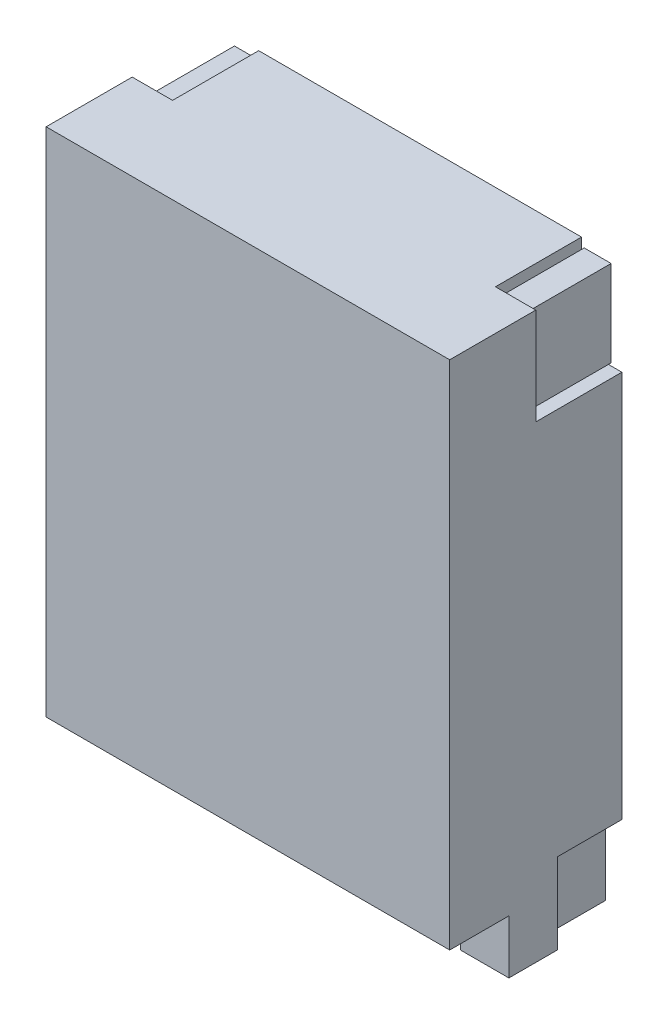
ISO-10303-21;
HEADER;
FILE_DESCRIPTION(('STEP AP214'),'2;1');
FILE_NAME('part.step','',(''),(''),'','','');
FILE_SCHEMA(('AUTOMOTIVE_DESIGN { 1 0 10303 214 1 1 1 1 }'));
ENDSEC;
DATA;
#1=APPLICATION_CONTEXT('core data for automotive mechanical design processes');
#2=APPLICATION_PROTOCOL_DEFINITION('international standard','automotive_design',2000,#1);
#3=PRODUCT_CONTEXT('',#1,'mechanical');
#4=PRODUCT('Part','Part','',(#3));
#5=PRODUCT_RELATED_PRODUCT_CATEGORY('part','',(#4));
#6=PRODUCT_DEFINITION_FORMATION('','',#4);
#7=PRODUCT_DEFINITION_CONTEXT('part definition',#1,'design');
#8=PRODUCT_DEFINITION('design','',#6,#7);
#9=PRODUCT_DEFINITION_SHAPE('','',#8);
#10=(LENGTH_UNIT() NAMED_UNIT(*) SI_UNIT(.MILLI.,.METRE.));
#11=(NAMED_UNIT(*) PLANE_ANGLE_UNIT() SI_UNIT($,.RADIAN.));
#12=(NAMED_UNIT(*) SI_UNIT($,.STERADIAN.) SOLID_ANGLE_UNIT());
#13=UNCERTAINTY_MEASURE_WITH_UNIT(LENGTH_MEASURE(1.E-05),#10,'distance_accuracy_value','');
#14=(GEOMETRIC_REPRESENTATION_CONTEXT(3) GLOBAL_UNCERTAINTY_ASSIGNED_CONTEXT((#13)) GLOBAL_UNIT_ASSIGNED_CONTEXT((#10,
#11,#12)) REPRESENTATION_CONTEXT('',''));
#15=CARTESIAN_POINT('',(0.,0.,0.));
#16=DIRECTION('',(0.,0.,1.));
#17=DIRECTION('',(1.,0.,0.));
#18=AXIS2_PLACEMENT_3D('',#15,#16,#17);
#19=CARTESIAN_POINT('',(3.2,0.,-0.35));
#20=DIRECTION('',(1.,0.,0.));
#21=DIRECTION('',(0.,1.,0.));
#22=AXIS2_PLACEMENT_3D('',#19,#20,#21);
#23=PLANE('',#22);
#24=DIRECTION('',(-3.475566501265E-09,0.,-1.));
#25=VECTOR('',#24,1.);
#26=CARTESIAN_POINT('',(3.200000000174,0.,-0.3));
#27=LINE('',#26,#25);
#28=CARTESIAN_POINT('',(3.200000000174,0.,-0.3));
#29=VERTEX_POINT('',#28);
#30=CARTESIAN_POINT('',(3.2,0.,-0.35));
#31=VERTEX_POINT('',#30);
#32=EDGE_CURVE('E614',#29,#31,#27,.T.);
#33=ORIENTED_EDGE('',*,*,#32,.F.);
#34=DIRECTION('',(9.25179932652E-11,1.,0.));
#35=VECTOR('',#34,1.);
#36=CARTESIAN_POINT('',(3.200000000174,0.,-0.3));
#37=LINE('',#36,#35);
#38=CARTESIAN_POINT('',(3.200000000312,1.500000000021,-0.3));
#39=VERTEX_POINT('',#38);
#40=EDGE_CURVE('E776',#29,#39,#37,.T.);
#41=ORIENTED_EDGE('',*,*,#40,.T.);
#42=DIRECTION('',(-3.475566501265E-09,-4.15276701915E-10,-1.));
#43=VECTOR('',#42,1.);
#44=CARTESIAN_POINT('',(3.200000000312,1.500000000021,-0.3));
#45=LINE('',#44,#43);
#46=CARTESIAN_POINT('',(3.200000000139,1.5,-0.35));
#47=VERTEX_POINT('',#46);
#48=EDGE_CURVE('E670',#39,#47,#45,.T.);
#49=ORIENTED_EDGE('',*,*,#48,.T.);
#50=DIRECTION('',(9.251799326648E-11,1.,0.));
#51=VECTOR('',#50,1.);
#52=CARTESIAN_POINT('',(3.2,0.,-0.35));
#53=LINE('',#52,#51);
#54=EDGE_CURVE('E678',#31,#47,#53,.T.);
#55=ORIENTED_EDGE('',*,*,#54,.F.);
#56=EDGE_LOOP('',(#33,#41,#49,#55));
#57=FACE_BOUND('',#56,.T.);
#58=ADVANCED_FACE('F17',(#57),#23,.F.);
#59=CARTESIAN_POINT('',(3.4,0.,0.9));
#60=DIRECTION('',(0.,0.,1.));
#61=DIRECTION('',(1.,0.,0.));
#62=AXIS2_PLACEMENT_3D('',#59,#60,#61);
#63=PLANE('',#62);
#64=DIRECTION('',(-1.,0.,0.));
#65=VECTOR('',#64,1.);
#66=CARTESIAN_POINT('',(3.75,0.,0.9000000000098));
#67=LINE('',#66,#65);
#68=CARTESIAN_POINT('',(3.75,0.,0.9000000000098));
#69=VERTEX_POINT('',#68);
#70=CARTESIAN_POINT('',(3.399999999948,0.,0.9000000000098));
#71=VERTEX_POINT('',#70);
#72=EDGE_CURVE('E617',#69,#71,#67,.T.);
#73=ORIENTED_EDGE('',*,*,#72,.T.);
#74=DIRECTION('',(-1.155579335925E-11,-1.,6.525890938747E-12));
#75=VECTOR('',#74,1.);
#76=CARTESIAN_POINT('',(3.399999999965,1.5,0.9));
#77=LINE('',#76,#75);
#78=CARTESIAN_POINT('',(3.399999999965,1.5,0.9));
#79=VERTEX_POINT('',#78);
#80=EDGE_CURVE('E597',#79,#71,#77,.T.);
#81=ORIENTED_EDGE('',*,*,#80,.F.);
#82=DIRECTION('',(1.,1.485706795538E-10,0.));
#83=VECTOR('',#82,1.);
#84=CARTESIAN_POINT('',(3.399999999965,1.5,0.9));
#85=LINE('',#84,#83);
#86=CARTESIAN_POINT('',(3.75,1.500000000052,0.9));
#87=VERTEX_POINT('',#86);
#88=EDGE_CURVE('E635',#79,#87,#85,.T.);
#89=ORIENTED_EDGE('',*,*,#88,.T.);
#90=DIRECTION('',(0.,-1.,6.52589093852E-12));
#91=VECTOR('',#90,1.);
#92=CARTESIAN_POINT('',(3.75,1.500000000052,0.9));
#93=LINE('',#92,#91);
#94=EDGE_CURVE('E741',#87,#69,#93,.T.);
#95=ORIENTED_EDGE('',*,*,#94,.T.);
#96=EDGE_LOOP('',(#73,#81,#89,#95));
#97=FACE_BOUND('',#96,.T.);
#98=ADVANCED_FACE('F1072',(#97),#63,.F.);
#99=CARTESIAN_POINT('',(-3.75,0.,1.8));
#100=DIRECTION('',(0.,0.,1.));
#101=DIRECTION('',(1.,0.,0.));
#102=AXIS2_PLACEMENT_3D('',#99,#100,#101);
#103=PLANE('',#102);
#104=DIRECTION('',(1.,0.,0.));
#105=VECTOR('',#104,1.);
#106=CARTESIAN_POINT('',(-3.75,1.,1.8));
#107=LINE('',#106,#105);
#108=CARTESIAN_POINT('',(-3.75,1.,1.8));
#109=VERTEX_POINT('',#108);
#110=CARTESIAN_POINT('',(-3.399999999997,1.,1.8));
#111=VERTEX_POINT('',#110);
#112=EDGE_CURVE('E470',#109,#111,#107,.T.);
#113=ORIENTED_EDGE('',*,*,#112,.F.);
#114=DIRECTION('',(0.,-1.,-1.110223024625E-13));
#115=VECTOR('',#114,1.);
#116=CARTESIAN_POINT('',(-3.75,1.,1.8));
#117=LINE('',#116,#115);
#118=CARTESIAN_POINT('',(-3.75,0.,1.8));
#119=VERTEX_POINT('',#118);
#120=EDGE_CURVE('E717',#109,#119,#117,.T.);
#121=ORIENTED_EDGE('',*,*,#120,.T.);
#122=DIRECTION('',(1.,0.,-1.2468297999E-11));
#123=VECTOR('',#122,1.);
#124=CARTESIAN_POINT('',(-3.75,0.,1.8));
#125=LINE('',#124,#123);
#126=CARTESIAN_POINT('',(-2.85,0.,1.799999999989));
#127=VERTEX_POINT('',#126);
#128=EDGE_CURVE('E695',#119,#127,#125,.T.);
#129=ORIENTED_EDGE('',*,*,#128,.T.);
#130=DIRECTION('',(0.,-1.,0.));
#131=VECTOR('',#130,1.);
#132=CARTESIAN_POINT('',(-2.85,3.199999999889,1.799999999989));
#133=LINE('',#132,#131);
#134=CARTESIAN_POINT('',(-2.85,3.199999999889,1.799999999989));
#135=VERTEX_POINT('',#134);
#136=EDGE_CURVE('E435',#135,#127,#133,.T.);
#137=ORIENTED_EDGE('',*,*,#136,.F.);
#138=DIRECTION('',(-1.,1.050553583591E-11,2.040428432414E-11));
#139=VECTOR('',#138,1.);
#140=CARTESIAN_POINT('',(-2.85,3.199999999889,1.799999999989));
#141=LINE('',#140,#139);
#142=CARTESIAN_POINT('',(-3.399999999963,3.199999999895,1.8));
#143=VERTEX_POINT('',#142);
#144=EDGE_CURVE('E416',#135,#143,#141,.T.);
#145=ORIENTED_EDGE('',*,*,#144,.T.);
#146=DIRECTION('',(-1.575729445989E-11,-1.,0.));
#147=VECTOR('',#146,1.);
#148=CARTESIAN_POINT('',(-3.399999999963,3.199999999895,1.8));
#149=LINE('',#148,#147);
#150=EDGE_CURVE('E525',#143,#111,#149,.T.);
#151=ORIENTED_EDGE('',*,*,#150,.T.);
#152=EDGE_LOOP('',(#113,#121,#129,#137,#145,#151));
#153=FACE_BOUND('',#152,.T.);
#154=ADVANCED_FACE('F1076',(#153),#103,.T.);
#155=CARTESIAN_POINT('',(2.85,3.2,2.6));
#156=DIRECTION('',(0.,-1.,0.));
#157=DIRECTION('',(0.,0.,-1.));
#158=AXIS2_PLACEMENT_3D('',#155,#156,#157);
#159=PLANE('',#158);
#160=DIRECTION('',(-1.,-1.008090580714E-10,-2.01858731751E-13));
#161=VECTOR('',#160,1.);
#162=CARTESIAN_POINT('',(3.399999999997,3.199999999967,2.599999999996));
#163=LINE('',#162,#161);
#164=CARTESIAN_POINT('',(3.399999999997,3.199999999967,2.599999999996));
#165=VERTEX_POINT('',#164);
#166=CARTESIAN_POINT('',(2.85,3.199999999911,2.599999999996));
#167=VERTEX_POINT('',#166);
#168=EDGE_CURVE('E524',#165,#167,#163,.T.);
#169=ORIENTED_EDGE('',*,*,#168,.T.);
#170=DIRECTION('',(0.,1.393329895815E-13,1.));
#171=VECTOR('',#170,1.);
#172=CARTESIAN_POINT('',(2.85,3.199999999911,1.799999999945));
#173=LINE('',#172,#171);
#174=CARTESIAN_POINT('',(2.85,3.199999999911,1.799999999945));
#175=VERTEX_POINT('',#174);
#176=EDGE_CURVE('E509',#175,#167,#173,.T.);
#177=ORIENTED_EDGE('',*,*,#176,.F.);
#178=DIRECTION('',(1.,1.008090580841E-10,4.020178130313E-11));
#179=VECTOR('',#178,1.);
#180=CARTESIAN_POINT('',(2.85,3.199999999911,1.799999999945));
#181=LINE('',#180,#179);
#182=CARTESIAN_POINT('',(3.399999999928,3.199999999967,1.799999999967));
#183=VERTEX_POINT('',#182);
#184=EDGE_CURVE('E514',#175,#183,#181,.T.);
#185=ORIENTED_EDGE('',*,*,#184,.T.);
#186=DIRECTION('',(-8.666622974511E-11,-1.393329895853E-13,-1.));
#187=VECTOR('',#186,1.);
#188=CARTESIAN_POINT('',(3.399999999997,3.199999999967,2.599999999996));
#189=LINE('',#188,#187);
#190=EDGE_CURVE('E11',#165,#183,#189,.T.);
#191=ORIENTED_EDGE('',*,*,#190,.F.);
#192=EDGE_LOOP('',(#169,#177,#185,#191));
#193=FACE_BOUND('',#192,.T.);
#194=ADVANCED_FACE('F922',(#193),#159,.T.);
#195=CARTESIAN_POINT('',(3.4,1.,1.8));
#196=DIRECTION('',(-1.,0.,0.));
#197=DIRECTION('',(0.,0.,1.));
#198=AXIS2_PLACEMENT_3D('',#195,#196,#197);
#199=PLANE('',#198);
#200=DIRECTION('',(8.666622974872E-11,0.,1.));
#201=VECTOR('',#200,1.);
#202=CARTESIAN_POINT('',(3.399999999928,0.9999999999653,1.8));
#203=LINE('',#202,#201);
#204=CARTESIAN_POINT('',(3.399999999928,0.9999999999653,1.8));
#205=VERTEX_POINT('',#204);
#206=CARTESIAN_POINT('',(3.399999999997,0.9999999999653,2.599999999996));
#207=VERTEX_POINT('',#206);
#208=EDGE_CURVE('E663',#205,#207,#203,.T.);
#209=ORIENTED_EDGE('',*,*,#208,.T.);
#210=DIRECTION('',(0.,-1.,0.));
#211=VECTOR('',#210,1.);
#212=CARTESIAN_POINT('',(3.399999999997,3.199999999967,2.599999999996));
#213=LINE('',#212,#211);
#214=EDGE_CURVE('E530',#165,#207,#213,.T.);
#215=ORIENTED_EDGE('',*,*,#214,.F.);
#216=ORIENTED_EDGE('',*,*,#190,.T.);
#217=DIRECTION('',(0.,1.,-1.515161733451E-11));
#218=VECTOR('',#217,1.);
#219=CARTESIAN_POINT('',(3.399999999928,0.9999999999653,1.8));
#220=LINE('',#219,#218);
#221=EDGE_CURVE('E510',#205,#183,#220,.T.);
#222=ORIENTED_EDGE('',*,*,#221,.F.);
#223=EDGE_LOOP('',(#209,#215,#216,#222));
#224=FACE_BOUND('',#223,.T.);
#225=ADVANCED_FACE('F930',(#224),#199,.T.);
#226=CARTESIAN_POINT('',(-2.85,7.2,2.6));
#227=DIRECTION('',(0.,-1.,0.));
#228=DIRECTION('',(0.,0.,-1.));
#229=AXIS2_PLACEMENT_3D('',#226,#227,#228);
#230=PLANE('',#229);
#231=DIRECTION('',(0.,0.,1.));
#232=VECTOR('',#231,1.);
#233=CARTESIAN_POINT('',(-2.85,7.2,0.));
#234=LINE('',#233,#232);
#235=CARTESIAN_POINT('',(-2.85,7.2,0.));
#236=VERTEX_POINT('',#235);
#237=CARTESIAN_POINT('',(-2.85,7.2,2.6));
#238=VERTEX_POINT('',#237);
#239=EDGE_CURVE('E428',#236,#238,#234,.T.);
#240=ORIENTED_EDGE('',*,*,#239,.F.);
#241=DIRECTION('',(1.,0.,0.));
#242=VECTOR('',#241,1.);
#243=CARTESIAN_POINT('',(-2.85,7.2,0.));
#244=LINE('',#243,#242);
#245=CARTESIAN_POINT('',(-0.5499999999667,7.2,0.));
#246=VERTEX_POINT('',#245);
#247=EDGE_CURVE('E518',#236,#246,#244,.T.);
#248=ORIENTED_EDGE('',*,*,#247,.T.);
#249=DIRECTION('',(6.410086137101E-12,0.,-1.));
#250=VECTOR('',#249,1.);
#251=CARTESIAN_POINT('',(-0.5499999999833,7.2,2.6));
#252=LINE('',#251,#250);
#253=CARTESIAN_POINT('',(-0.5499999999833,7.2,2.6));
#254=VERTEX_POINT('',#253);
#255=EDGE_CURVE('E20',#254,#246,#252,.T.);
#256=ORIENTED_EDGE('',*,*,#255,.F.);
#257=DIRECTION('',(1.,0.,0.));
#258=VECTOR('',#257,1.);
#259=CARTESIAN_POINT('',(-2.85,7.2,2.6));
#260=LINE('',#259,#258);
#261=EDGE_CURVE('E526',#238,#254,#260,.T.);
#262=ORIENTED_EDGE('',*,*,#261,.F.);
#263=EDGE_LOOP('',(#240,#248,#256,#262));
#264=FACE_BOUND('',#263,.T.);
#265=ADVANCED_FACE('F561',(#264),#230,.T.);
#266=CARTESIAN_POINT('',(-0.55,2.2,0.));
#267=DIRECTION('',(-1.,0.,0.));
#268=DIRECTION('',(0.,0.,1.));
#269=AXIS2_PLACEMENT_3D('',#266,#267,#268);
#270=PLANE('',#269);
#271=ORIENTED_EDGE('',*,*,#255,.T.);
#272=DIRECTION('',(0.,-1.,0.));
#273=VECTOR('',#272,1.);
#274=CARTESIAN_POINT('',(-0.5499999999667,7.2,0.));
#275=LINE('',#274,#273);
#276=CARTESIAN_POINT('',(-0.5499999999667,2.200000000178,0.));
#277=VERTEX_POINT('',#276);
#278=EDGE_CURVE('E500',#246,#277,#275,.T.);
#279=ORIENTED_EDGE('',*,*,#278,.T.);
#280=DIRECTION('',(-6.410086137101E-12,0.,1.));
#281=VECTOR('',#280,1.);
#282=CARTESIAN_POINT('',(-0.5499999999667,2.200000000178,0.));
#283=LINE('',#282,#281);
#284=CARTESIAN_POINT('',(-0.5499999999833,2.200000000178,2.6));
#285=VERTEX_POINT('',#284);
#286=EDGE_CURVE('E547',#277,#285,#283,.T.);
#287=ORIENTED_EDGE('',*,*,#286,.T.);
#288=DIRECTION('',(0.,-1.,0.));
#289=VECTOR('',#288,1.);
#290=CARTESIAN_POINT('',(-0.5499999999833,7.2,2.6));
#291=LINE('',#290,#289);
#292=EDGE_CURVE('E529',#254,#285,#291,.T.);
#293=ORIENTED_EDGE('',*,*,#292,.F.);
#294=EDGE_LOOP('',(#271,#279,#287,#293));
#295=FACE_BOUND('',#294,.T.);
#296=ADVANCED_FACE('F556',(#295),#270,.T.);
#297=CARTESIAN_POINT('',(-0.55,2.2,2.6));
#298=DIRECTION('',(0.,-1.,0.));
#299=DIRECTION('',(0.,0.,-1.));
#300=AXIS2_PLACEMENT_3D('',#297,#298,#299);
#301=PLANE('',#300);
#302=ORIENTED_EDGE('',*,*,#286,.F.);
#303=DIRECTION('',(1.,-1.768690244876E-10,0.));
#304=VECTOR('',#303,1.);
#305=CARTESIAN_POINT('',(-0.5499999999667,2.200000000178,0.));
#306=LINE('',#305,#304);
#307=CARTESIAN_POINT('',(0.5499999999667,2.199999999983,0.));
#308=VERTEX_POINT('',#307);
#309=EDGE_CURVE('E497',#277,#308,#306,.T.);
#310=ORIENTED_EDGE('',*,*,#309,.T.);
#311=DIRECTION('',(-6.410256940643E-12,0.,-1.));
#312=VECTOR('',#311,1.);
#313=CARTESIAN_POINT('',(0.5499999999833,2.199999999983,2.6));
#314=LINE('',#313,#312);
#315=CARTESIAN_POINT('',(0.5499999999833,2.199999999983,2.6));
#316=VERTEX_POINT('',#315);
#317=EDGE_CURVE('E48',#316,#308,#314,.T.);
#318=ORIENTED_EDGE('',*,*,#317,.F.);
#319=DIRECTION('',(-1.,1.768686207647E-10,0.));
#320=VECTOR('',#319,1.);
#321=CARTESIAN_POINT('',(0.5499999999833,2.199999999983,2.6));
#322=LINE('',#321,#320);
#323=EDGE_CURVE('E534',#316,#285,#322,.T.);
#324=ORIENTED_EDGE('',*,*,#323,.T.);
#325=EDGE_LOOP('',(#302,#310,#318,#324));
#326=FACE_BOUND('',#325,.T.);
#327=ADVANCED_FACE('F569',(#326),#301,.T.);
#328=CARTESIAN_POINT('',(0.55,2.2,2.6));
#329=DIRECTION('',(1.,0.,0.));
#330=DIRECTION('',(0.,1.,0.));
#331=AXIS2_PLACEMENT_3D('',#328,#329,#330);
#332=PLANE('',#331);
#333=ORIENTED_EDGE('',*,*,#317,.T.);
#334=DIRECTION('',(3.333266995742E-12,1.,0.));
#335=VECTOR('',#334,1.);
#336=CARTESIAN_POINT('',(0.5499999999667,2.199999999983,0.));
#337=LINE('',#336,#335);
#338=CARTESIAN_POINT('',(0.5499999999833,7.2,0.));
#339=VERTEX_POINT('',#338);
#340=EDGE_CURVE('E501',#308,#339,#337,.T.);
#341=ORIENTED_EDGE('',*,*,#340,.T.);
#342=DIRECTION('',(-6.4103850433E-12,0.,-1.));
#343=VECTOR('',#342,1.);
#344=CARTESIAN_POINT('',(0.55,7.2,2.6));
#345=LINE('',#344,#343);
#346=CARTESIAN_POINT('',(0.55,7.2,2.6));
#347=VERTEX_POINT('',#346);
#348=EDGE_CURVE('E38',#347,#339,#345,.T.);
#349=ORIENTED_EDGE('',*,*,#348,.F.);
#350=DIRECTION('',(3.333333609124E-12,1.,0.));
#351=VECTOR('',#350,1.);
#352=CARTESIAN_POINT('',(0.5499999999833,2.199999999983,2.6));
#353=LINE('',#352,#351);
#354=EDGE_CURVE('E537',#316,#347,#353,.T.);
#355=ORIENTED_EDGE('',*,*,#354,.F.);
#356=EDGE_LOOP('',(#333,#341,#349,#355));
#357=FACE_BOUND('',#356,.T.);
#358=ADVANCED_FACE('F573',(#357),#332,.T.);
#359=CARTESIAN_POINT('',(0.55,7.2,2.6));
#360=DIRECTION('',(0.,-1.,0.));
#361=DIRECTION('',(0.,0.,-1.));
#362=AXIS2_PLACEMENT_3D('',#359,#360,#361);
#363=PLANE('',#362);
#364=ORIENTED_EDGE('',*,*,#348,.T.);
#365=DIRECTION('',(1.,0.,0.));
#366=VECTOR('',#365,1.);
#367=CARTESIAN_POINT('',(0.5499999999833,7.2,0.));
#368=LINE('',#367,#366);
#369=CARTESIAN_POINT('',(2.85,7.2,0.));
#370=VERTEX_POINT('',#369);
#371=EDGE_CURVE('E575',#339,#370,#368,.T.);
#372=ORIENTED_EDGE('',*,*,#371,.T.);
#373=DIRECTION('',(0.,0.,-1.));
#374=VECTOR('',#373,1.);
#375=CARTESIAN_POINT('',(2.85,7.2,2.6));
#376=LINE('',#375,#374);
#377=CARTESIAN_POINT('',(2.85,7.2,2.6));
#378=VERTEX_POINT('',#377);
#379=EDGE_CURVE('E508',#378,#370,#376,.T.);
#380=ORIENTED_EDGE('',*,*,#379,.F.);
#381=DIRECTION('',(-1.,0.,0.));
#382=VECTOR('',#381,1.);
#383=CARTESIAN_POINT('',(2.85,7.2,2.6));
#384=LINE('',#383,#382);
#385=EDGE_CURVE('E541',#378,#347,#384,.T.);
#386=ORIENTED_EDGE('',*,*,#385,.T.);
#387=EDGE_LOOP('',(#364,#372,#380,#386));
#388=FACE_BOUND('',#387,.T.);
#389=ADVANCED_FACE('F1095',(#388),#363,.T.);
#390=CARTESIAN_POINT('',(3.4,1.,2.6));
#391=DIRECTION('',(0.,0.,-1.));
#392=DIRECTION('',(0.,-1.,0.));
#393=AXIS2_PLACEMENT_3D('',#390,#391,#392);
#394=PLANE('',#393);
#395=ORIENTED_EDGE('',*,*,#168,.F.);
#396=ORIENTED_EDGE('',*,*,#214,.T.);
#397=DIRECTION('',(1.,-5.09804616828E-12,0.));
#398=VECTOR('',#397,1.);
#399=CARTESIAN_POINT('',(-3.399999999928,1.,2.599999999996));
#400=LINE('',#399,#398);
#401=CARTESIAN_POINT('',(-3.399999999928,1.,2.599999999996));
#402=VERTEX_POINT('',#401);
#403=EDGE_CURVE('E667',#402,#207,#400,.T.);
#404=ORIENTED_EDGE('',*,*,#403,.F.);
#405=DIRECTION('',(1.575749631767E-11,1.,1.868808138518E-12));
#406=VECTOR('',#405,1.);
#407=CARTESIAN_POINT('',(-3.399999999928,1.,2.599999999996));
#408=LINE('',#407,#406);
#409=CARTESIAN_POINT('',(-3.399999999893,3.200000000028,2.6));
#410=VERTEX_POINT('',#409);
#411=EDGE_CURVE('E410',#402,#410,#408,.T.);
#412=ORIENTED_EDGE('',*,*,#411,.T.);
#413=DIRECTION('',(1.,-1.050392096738E-11,0.));
#414=VECTOR('',#413,1.);
#415=CARTESIAN_POINT('',(-3.399999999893,3.200000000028,2.6));
#416=LINE('',#415,#414);
#417=CARTESIAN_POINT('',(-2.85,3.200000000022,2.6));
#418=VERTEX_POINT('',#417);
#419=EDGE_CURVE('E401',#410,#418,#416,.T.);
#420=ORIENTED_EDGE('',*,*,#419,.T.);
#421=DIRECTION('',(0.,-1.,0.));
#422=VECTOR('',#421,1.);
#423=CARTESIAN_POINT('',(-2.85,7.2,2.6));
#424=LINE('',#423,#422);
#425=EDGE_CURVE('E407',#238,#418,#424,.T.);
#426=ORIENTED_EDGE('',*,*,#425,.F.);
#427=ORIENTED_EDGE('',*,*,#261,.T.);
#428=ORIENTED_EDGE('',*,*,#292,.T.);
#429=ORIENTED_EDGE('',*,*,#323,.F.);
#430=ORIENTED_EDGE('',*,*,#354,.T.);
#431=ORIENTED_EDGE('',*,*,#385,.F.);
#432=DIRECTION('',(0.,1.,1.027844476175E-12));
#433=VECTOR('',#432,1.);
#434=CARTESIAN_POINT('',(2.85,3.199999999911,2.599999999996));
#435=LINE('',#434,#433);
#436=EDGE_CURVE('E504',#167,#378,#435,.T.);
#437=ORIENTED_EDGE('',*,*,#436,.F.);
#438=EDGE_LOOP('',(#395,#396,#404,#412,#420,#426,#427,#428,#429,#430,#431,#437));
#439=FACE_BOUND('',#438,.T.);
#440=ADVANCED_FACE('F404',(#439),#394,.T.);
#441=CARTESIAN_POINT('',(-3.4,1.,2.6));
#442=DIRECTION('',(1.,0.,0.));
#443=DIRECTION('',(0.,1.,0.));
#444=AXIS2_PLACEMENT_3D('',#441,#442,#443);
#445=PLANE('',#444);
#446=DIRECTION('',(-8.666622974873E-11,0.,-1.));
#447=VECTOR('',#446,1.);
#448=CARTESIAN_POINT('',(-3.399999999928,1.,2.599999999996));
#449=LINE('',#448,#447);
#450=EDGE_CURVE('E474',#402,#111,#449,.T.);
#451=ORIENTED_EDGE('',*,*,#450,.T.);
#452=ORIENTED_EDGE('',*,*,#150,.F.);
#453=DIRECTION('',(-8.666733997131E-11,-1.663891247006E-10,-1.));
#454=VECTOR('',#453,1.);
#455=CARTESIAN_POINT('',(-3.399999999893,3.200000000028,2.6));
#456=LINE('',#455,#454);
#457=EDGE_CURVE('E415',#410,#143,#456,.T.);
#458=ORIENTED_EDGE('',*,*,#457,.F.);
#459=ORIENTED_EDGE('',*,*,#411,.F.);
#460=EDGE_LOOP('',(#451,#452,#458,#459));
#461=FACE_BOUND('',#460,.T.);
#462=ADVANCED_FACE('F1098',(#461),#445,.T.);
#463=CARTESIAN_POINT('',(-3.4,3.2,2.6));
#464=DIRECTION('',(0.,-1.,0.));
#465=DIRECTION('',(0.,0.,-1.));
#466=AXIS2_PLACEMENT_3D('',#463,#464,#465);
#467=PLANE('',#466);
#468=ORIENTED_EDGE('',*,*,#144,.F.);
#469=DIRECTION('',(0.,-1.663891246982E-10,-1.));
#470=VECTOR('',#469,1.);
#471=CARTESIAN_POINT('',(-2.85,3.200000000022,2.6));
#472=LINE('',#471,#470);
#473=EDGE_CURVE('E419',#418,#135,#472,.T.);
#474=ORIENTED_EDGE('',*,*,#473,.F.);
#475=ORIENTED_EDGE('',*,*,#419,.F.);
#476=ORIENTED_EDGE('',*,*,#457,.T.);
#477=EDGE_LOOP('',(#468,#474,#475,#476));
#478=FACE_BOUND('',#477,.T.);
#479=ADVANCED_FACE('F420',(#478),#467,.T.);
#480=CARTESIAN_POINT('',(-2.85,0.,0.));
#481=DIRECTION('',(1.,0.,0.));
#482=DIRECTION('',(0.,1.,0.));
#483=AXIS2_PLACEMENT_3D('',#480,#481,#482);
#484=PLANE('',#483);
#485=ORIENTED_EDGE('',*,*,#136,.T.);
#486=DIRECTION('',(0.,0.,-1.));
#487=VECTOR('',#486,1.);
#488=CARTESIAN_POINT('',(-2.85,0.,1.799999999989));
#489=LINE('',#488,#487);
#490=CARTESIAN_POINT('',(-2.85,0.,5.833333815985E-11));
#491=VERTEX_POINT('',#490);
#492=EDGE_CURVE('E700',#127,#491,#489,.T.);
#493=ORIENTED_EDGE('',*,*,#492,.T.);
#494=DIRECTION('',(0.,1.,-8.101852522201E-12));
#495=VECTOR('',#494,1.);
#496=CARTESIAN_POINT('',(-2.85,0.,5.833333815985E-11));
#497=LINE('',#496,#495);
#498=EDGE_CURVE('E564',#491,#236,#497,.T.);
#499=ORIENTED_EDGE('',*,*,#498,.T.);
#500=ORIENTED_EDGE('',*,*,#239,.T.);
#501=ORIENTED_EDGE('',*,*,#425,.T.);
#502=ORIENTED_EDGE('',*,*,#473,.T.);
#503=EDGE_LOOP('',(#485,#493,#499,#500,#501,#502));
#504=FACE_BOUND('',#503,.T.);
#505=ADVANCED_FACE('F426',(#504),#484,.T.);
#506=CARTESIAN_POINT('',(2.85,0.,0.));
#507=DIRECTION('',(0.,0.,-1.));
#508=DIRECTION('',(0.,-1.,0.));
#509=AXIS2_PLACEMENT_3D('',#506,#507,#508);
#510=PLANE('',#509);
#511=ORIENTED_EDGE('',*,*,#371,.F.);
#512=ORIENTED_EDGE('',*,*,#340,.F.);
#513=ORIENTED_EDGE('',*,*,#309,.F.);
#514=ORIENTED_EDGE('',*,*,#278,.F.);
#515=ORIENTED_EDGE('',*,*,#247,.F.);
#516=ORIENTED_EDGE('',*,*,#498,.F.);
#517=DIRECTION('',(1.,0.,0.));
#518=VECTOR('',#517,1.);
#519=CARTESIAN_POINT('',(-2.85,0.,5.833333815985E-11));
#520=LINE('',#519,#518);
#521=CARTESIAN_POINT('',(2.85,0.,5.833333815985E-11));
#522=VERTEX_POINT('',#521);
#523=EDGE_CURVE('E869',#491,#522,#520,.T.);
#524=ORIENTED_EDGE('',*,*,#523,.T.);
#525=DIRECTION('',(0.,-1.,8.101852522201E-12));
#526=VECTOR('',#525,1.);
#527=CARTESIAN_POINT('',(2.85,7.2,0.));
#528=LINE('',#527,#526);
#529=EDGE_CURVE('E579',#370,#522,#528,.T.);
#530=ORIENTED_EDGE('',*,*,#529,.F.);
#531=EDGE_LOOP('',(#511,#512,#513,#514,#515,#516,#524,#530));
#532=FACE_BOUND('',#531,.T.);
#533=ADVANCED_FACE('F567',(#532),#510,.F.);
#534=CARTESIAN_POINT('',(2.85,7.2,0.));
#535=DIRECTION('',(-1.,0.,0.));
#536=DIRECTION('',(0.,0.,1.));
#537=AXIS2_PLACEMENT_3D('',#534,#535,#536);
#538=PLANE('',#537);
#539=ORIENTED_EDGE('',*,*,#176,.T.);
#540=ORIENTED_EDGE('',*,*,#436,.T.);
#541=ORIENTED_EDGE('',*,*,#379,.T.);
#542=ORIENTED_EDGE('',*,*,#529,.T.);
#543=DIRECTION('',(0.,0.,1.));
#544=VECTOR('',#543,1.);
#545=CARTESIAN_POINT('',(2.85,0.,5.833333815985E-11));
#546=LINE('',#545,#544);
#547=CARTESIAN_POINT('',(2.85,0.,1.799999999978));
#548=VERTEX_POINT('',#547);
#549=EDGE_CURVE('E694',#522,#548,#546,.T.);
#550=ORIENTED_EDGE('',*,*,#549,.T.);
#551=DIRECTION('',(0.,1.,-1.041673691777E-11));
#552=VECTOR('',#551,1.);
#553=CARTESIAN_POINT('',(2.85,0.,1.799999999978));
#554=LINE('',#553,#552);
#555=EDGE_CURVE('E640',#548,#175,#554,.T.);
#556=ORIENTED_EDGE('',*,*,#555,.T.);
#557=EDGE_LOOP('',(#539,#540,#541,#542,#550,#556));
#558=FACE_BOUND('',#557,.T.);
#559=ADVANCED_FACE('F932',(#558),#538,.T.);
#560=CARTESIAN_POINT('',(2.85,0.,1.8));
#561=DIRECTION('',(0.,0.,1.));
#562=DIRECTION('',(1.,0.,0.));
#563=AXIS2_PLACEMENT_3D('',#560,#561,#562);
#564=PLANE('',#563);
#565=DIRECTION('',(0.,1.,0.));
#566=VECTOR('',#565,1.);
#567=CARTESIAN_POINT('',(3.75,0.,1.8));
#568=LINE('',#567,#566);
#569=CARTESIAN_POINT('',(3.75,0.,1.8));
#570=VERTEX_POINT('',#569);
#571=CARTESIAN_POINT('',(3.75,1.,1.8));
#572=VERTEX_POINT('',#571);
#573=EDGE_CURVE('E908',#570,#572,#568,.T.);
#574=ORIENTED_EDGE('',*,*,#573,.T.);
#575=DIRECTION('',(1.,9.907979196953E-11,0.));
#576=VECTOR('',#575,1.);
#577=CARTESIAN_POINT('',(3.399999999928,0.9999999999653,1.8));
#578=LINE('',#577,#576);
#579=EDGE_CURVE('E515',#205,#572,#578,.T.);
#580=ORIENTED_EDGE('',*,*,#579,.F.);
#581=ORIENTED_EDGE('',*,*,#221,.T.);
#582=ORIENTED_EDGE('',*,*,#184,.F.);
#583=ORIENTED_EDGE('',*,*,#555,.F.);
#584=DIRECTION('',(1.,0.,2.456726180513E-11));
#585=VECTOR('',#584,1.);
#586=CARTESIAN_POINT('',(2.85,0.,1.799999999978));
#587=LINE('',#586,#585);
#588=EDGE_CURVE('E691',#548,#570,#587,.T.);
#589=ORIENTED_EDGE('',*,*,#588,.T.);
#590=EDGE_LOOP('',(#574,#580,#581,#582,#583,#589));
#591=FACE_BOUND('',#590,.T.);
#592=ADVANCED_FACE('F927',(#591),#564,.T.);
#593=CARTESIAN_POINT('',(-3.75,1.,2.9));
#594=DIRECTION('',(0.,-1.,0.));
#595=DIRECTION('',(0.,0.,-1.));
#596=AXIS2_PLACEMENT_3D('',#593,#594,#595);
#597=PLANE('',#596);
#598=DIRECTION('',(0.,-1.262523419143E-10,1.));
#599=VECTOR('',#598,1.);
#600=CARTESIAN_POINT('',(3.75,1.,1.8));
#601=LINE('',#600,#599);
#602=CARTESIAN_POINT('',(3.75,0.9999999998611,2.9));
#603=VERTEX_POINT('',#602);
#604=EDGE_CURVE('E891',#572,#603,#601,.T.);
#605=ORIENTED_EDGE('',*,*,#604,.T.);
#606=DIRECTION('',(1.,0.,0.));
#607=VECTOR('',#606,1.);
#608=CARTESIAN_POINT('',(-3.75,0.9999999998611,2.9));
#609=LINE('',#608,#607);
#610=CARTESIAN_POINT('',(-3.75,0.9999999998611,2.9));
#611=VERTEX_POINT('',#610);
#612=EDGE_CURVE('E475',#611,#603,#609,.T.);
#613=ORIENTED_EDGE('',*,*,#612,.F.);
#614=DIRECTION('',(0.,1.262527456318E-10,-1.));
#615=VECTOR('',#614,1.);
#616=CARTESIAN_POINT('',(-3.75,0.9999999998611,2.9));
#617=LINE('',#616,#615);
#618=EDGE_CURVE('E439',#611,#109,#617,.T.);
#619=ORIENTED_EDGE('',*,*,#618,.T.);
#620=ORIENTED_EDGE('',*,*,#112,.T.);
#621=ORIENTED_EDGE('',*,*,#450,.F.);
#622=ORIENTED_EDGE('',*,*,#403,.T.);
#623=ORIENTED_EDGE('',*,*,#208,.F.);
#624=ORIENTED_EDGE('',*,*,#579,.T.);
#625=EDGE_LOOP('',(#605,#613,#619,#620,#621,#622,#623,#624));
#626=FACE_BOUND('',#625,.T.);
#627=ADVANCED_FACE('F1110',(#626),#597,.T.);
#628=CARTESIAN_POINT('',(-3.75,1.,2.9));
#629=DIRECTION('',(0.,0.,1.));
#630=DIRECTION('',(1.,0.,0.));
#631=AXIS2_PLACEMENT_3D('',#628,#629,#630);
#632=PLANE('',#631);
#633=DIRECTION('',(-1.,0.,0.));
#634=VECTOR('',#633,1.);
#635=CARTESIAN_POINT('',(3.75,10.5,2.9));
#636=LINE('',#635,#634);
#637=CARTESIAN_POINT('',(3.75,10.5,2.9));
#638=VERTEX_POINT('',#637);
#639=CARTESIAN_POINT('',(-3.75,10.5,2.9));
#640=VERTEX_POINT('',#639);
#641=EDGE_CURVE('E821',#638,#640,#636,.T.);
#642=ORIENTED_EDGE('',*,*,#641,.T.);
#643=DIRECTION('',(0.,-1.,0.));
#644=VECTOR('',#643,1.);
#645=CARTESIAN_POINT('',(-3.75,10.5,2.9));
#646=LINE('',#645,#644);
#647=EDGE_CURVE('E441',#640,#611,#646,.T.);
#648=ORIENTED_EDGE('',*,*,#647,.T.);
#649=ORIENTED_EDGE('',*,*,#612,.T.);
#650=DIRECTION('',(0.,1.,0.));
#651=VECTOR('',#650,1.);
#652=CARTESIAN_POINT('',(3.75,0.9999999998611,2.9));
#653=LINE('',#652,#651);
#654=EDGE_CURVE('E820',#603,#638,#653,.T.);
#655=ORIENTED_EDGE('',*,*,#654,.T.);
#656=EDGE_LOOP('',(#642,#648,#649,#655));
#657=FACE_BOUND('',#656,.T.);
#658=ADVANCED_FACE('F1115',(#657),#632,.T.);
#659=CARTESIAN_POINT('',(-3.75,8.7,1.3));
#660=DIRECTION('',(0.,0.,-1.));
#661=DIRECTION('',(0.,-1.,0.));
#662=AXIS2_PLACEMENT_3D('',#659,#660,#661);
#663=PLANE('',#662);
#664=DIRECTION('',(-6.571410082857E-12,-1.,0.));
#665=VECTOR('',#664,1.);
#666=CARTESIAN_POINT('',(-3.500000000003,10.30000000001,1.3));
#667=LINE('',#666,#665);
#668=CARTESIAN_POINT('',(-3.500000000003,10.30000000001,1.3));
#669=VERTEX_POINT('',#668);
#670=CARTESIAN_POINT('',(-3.500000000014,8.700000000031,1.3));
#671=VERTEX_POINT('',#670);
#672=EDGE_CURVE('E479',#669,#671,#667,.T.);
#673=ORIENTED_EDGE('',*,*,#672,.T.);
#674=DIRECTION('',(-1.,8.748344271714E-10,0.));
#675=VECTOR('',#674,1.);
#676=CARTESIAN_POINT('',(-3.500000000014,8.700000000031,1.3));
#677=LINE('',#676,#675);
#678=CARTESIAN_POINT('',(-3.75,8.70000000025,1.3));
#679=VERTEX_POINT('',#678);
#680=EDGE_CURVE('E460',#671,#679,#677,.T.);
#681=ORIENTED_EDGE('',*,*,#680,.T.);
#682=DIRECTION('',(0.,1.,0.));
#683=VECTOR('',#682,1.);
#684=CARTESIAN_POINT('',(-3.75,8.70000000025,1.3));
#685=LINE('',#684,#683);
#686=CARTESIAN_POINT('',(-3.75,10.5,1.3));
#687=VERTEX_POINT('',#686);
#688=EDGE_CURVE('E444',#679,#687,#685,.T.);
#689=ORIENTED_EDGE('',*,*,#688,.T.);
#690=DIRECTION('',(1.,0.,0.));
#691=VECTOR('',#690,1.);
#692=CARTESIAN_POINT('',(-3.75,10.5,1.3));
#693=LINE('',#692,#691);
#694=CARTESIAN_POINT('',(-3.,10.5,1.3));
#695=VERTEX_POINT('',#694);
#696=EDGE_CURVE('E886',#687,#695,#693,.T.);
#697=ORIENTED_EDGE('',*,*,#696,.T.);
#698=DIRECTION('',(0.,1.,0.));
#699=VECTOR('',#698,1.);
#700=CARTESIAN_POINT('',(-3.,10.30000000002,1.3));
#701=LINE('',#700,#699);
#702=CARTESIAN_POINT('',(-3.,10.30000000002,1.3));
#703=VERTEX_POINT('',#702);
#704=EDGE_CURVE('E493',#703,#695,#701,.T.);
#705=ORIENTED_EDGE('',*,*,#704,.F.);
#706=DIRECTION('',(-1.,-1.710986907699E-11,0.));
#707=VECTOR('',#706,1.);
#708=CARTESIAN_POINT('',(-3.,10.30000000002,1.3));
#709=LINE('',#708,#707);
#710=EDGE_CURVE('E494',#703,#669,#709,.T.);
#711=ORIENTED_EDGE('',*,*,#710,.T.);
#712=EDGE_LOOP('',(#673,#681,#689,#697,#705,#711));
#713=FACE_BOUND('',#712,.T.);
#714=ADVANCED_FACE('F1053',(#713),#663,.T.);
#715=CARTESIAN_POINT('',(-3.,10.3,1.3));
#716=DIRECTION('',(-1.,0.,0.));
#717=DIRECTION('',(0.,0.,1.));
#718=AXIS2_PLACEMENT_3D('',#715,#716,#717);
#719=PLANE('',#718);
#720=DIRECTION('',(0.,-1.,-2.919858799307E-11));
#721=VECTOR('',#720,1.);
#722=CARTESIAN_POINT('',(-3.,10.5,-0.3));
#723=LINE('',#722,#721);
#724=CARTESIAN_POINT('',(-3.,10.5,-0.3));
#725=VERTEX_POINT('',#724);
#726=CARTESIAN_POINT('',(-3.,10.30000000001,-0.3000000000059));
#727=VERTEX_POINT('',#726);
#728=EDGE_CURVE('E856',#725,#727,#723,.T.);
#729=ORIENTED_EDGE('',*,*,#728,.T.);
#730=DIRECTION('',(0.,4.447553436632E-12,1.));
#731=VECTOR('',#730,1.);
#732=CARTESIAN_POINT('',(-3.,10.30000000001,-0.3000000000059));
#733=LINE('',#732,#731);
#734=EDGE_CURVE('E489',#727,#703,#733,.T.);
#735=ORIENTED_EDGE('',*,*,#734,.T.);
#736=ORIENTED_EDGE('',*,*,#704,.T.);
#737=DIRECTION('',(0.,0.,-1.));
#738=VECTOR('',#737,1.);
#739=CARTESIAN_POINT('',(-3.,10.5,1.3));
#740=LINE('',#739,#738);
#741=EDGE_CURVE('E877',#695,#725,#740,.T.);
#742=ORIENTED_EDGE('',*,*,#741,.T.);
#743=EDGE_LOOP('',(#729,#735,#736,#742));
#744=FACE_BOUND('',#743,.T.);
#745=ADVANCED_FACE('F988',(#744),#719,.T.);
#746=CARTESIAN_POINT('',(-3.,10.3,-0.35));
#747=DIRECTION('',(0.,1.,0.));
#748=DIRECTION('',(1.,0.,0.));
#749=AXIS2_PLACEMENT_3D('',#746,#747,#748);
#750=PLANE('',#749);
#751=DIRECTION('',(0.,-1.621103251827E-10,-1.));
#752=VECTOR('',#751,1.);
#753=CARTESIAN_POINT('',(-3.,10.30000000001,-0.3000000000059));
#754=LINE('',#753,#752);
#755=CARTESIAN_POINT('',(-3.,10.3,-0.35));
#756=VERTEX_POINT('',#755);
#757=EDGE_CURVE('E655',#727,#756,#754,.T.);
#758=ORIENTED_EDGE('',*,*,#757,.T.);
#759=DIRECTION('',(1.,-3.335998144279E-12,0.));
#760=VECTOR('',#759,1.);
#761=CARTESIAN_POINT('',(-3.500000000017,10.3,-0.35));
#762=LINE('',#761,#760);
#763=CARTESIAN_POINT('',(-3.500000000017,10.3,-0.35));
#764=VERTEX_POINT('',#763);
#765=EDGE_CURVE('E488',#764,#756,#762,.T.);
#766=ORIENTED_EDGE('',*,*,#765,.F.);
#767=DIRECTION('',(8.35022287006E-12,3.029495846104E-12,1.));
#768=VECTOR('',#767,1.);
#769=CARTESIAN_POINT('',(-3.500000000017,10.3,-0.35));
#770=LINE('',#769,#768);
#771=EDGE_CURVE('E466',#764,#669,#770,.T.);
#772=ORIENTED_EDGE('',*,*,#771,.T.);
#773=ORIENTED_EDGE('',*,*,#710,.F.);
#774=ORIENTED_EDGE('',*,*,#734,.F.);
#775=EDGE_LOOP('',(#758,#766,#772,#773,#774));
#776=FACE_BOUND('',#775,.T.);
#777=ADVANCED_FACE('F984',(#776),#750,.T.);
#778=CARTESIAN_POINT('',(-3.,8.7,-0.3));
#779=DIRECTION('',(-1.,0.,0.));
#780=DIRECTION('',(0.,0.,1.));
#781=AXIS2_PLACEMENT_3D('',#778,#779,#780);
#782=PLANE('',#781);
#783=ORIENTED_EDGE('',*,*,#757,.F.);
#784=DIRECTION('',(0.,-1.,3.665436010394E-12));
#785=VECTOR('',#784,1.);
#786=CARTESIAN_POINT('',(-3.,10.30000000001,-0.3000000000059));
#787=LINE('',#786,#785);
#788=CARTESIAN_POINT('',(-3.,8.700000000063,-0.3));
#789=VERTEX_POINT('',#788);
#790=EDGE_CURVE('E803',#727,#789,#787,.T.);
#791=ORIENTED_EDGE('',*,*,#790,.T.);
#792=DIRECTION('',(0.,1.248032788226E-09,1.));
#793=VECTOR('',#792,1.);
#794=CARTESIAN_POINT('',(-3.,8.7,-0.35));
#795=LINE('',#794,#793);
#796=CARTESIAN_POINT('',(-3.,8.7,-0.35));
#797=VERTEX_POINT('',#796);
#798=EDGE_CURVE('E482',#797,#789,#795,.T.);
#799=ORIENTED_EDGE('',*,*,#798,.F.);
#800=DIRECTION('',(0.,-1.,0.));
#801=VECTOR('',#800,1.);
#802=CARTESIAN_POINT('',(-3.,10.3,-0.35));
#803=LINE('',#802,#801);
#804=EDGE_CURVE('E761',#756,#797,#803,.T.);
#805=ORIENTED_EDGE('',*,*,#804,.F.);
#806=EDGE_LOOP('',(#783,#791,#799,#805));
#807=FACE_BOUND('',#806,.T.);
#808=ADVANCED_FACE('F967',(#807),#782,.F.);
#809=CARTESIAN_POINT('',(-3.5,8.7,-0.35));
#810=DIRECTION('',(0.,0.,-1.));
#811=DIRECTION('',(0.,-1.,0.));
#812=AXIS2_PLACEMENT_3D('',#809,#810,#811);
#813=PLANE('',#812);
#814=ORIENTED_EDGE('',*,*,#765,.T.);
#815=ORIENTED_EDGE('',*,*,#804,.T.);
#816=DIRECTION('',(-1.,-3.09086090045E-13,0.));
#817=VECTOR('',#816,1.);
#818=CARTESIAN_POINT('',(-3.,8.7,-0.35));
#819=LINE('',#818,#817);
#820=CARTESIAN_POINT('',(-3.500000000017,8.7,-0.35));
#821=VERTEX_POINT('',#820);
#822=EDGE_CURVE('E485',#797,#821,#819,.T.);
#823=ORIENTED_EDGE('',*,*,#822,.T.);
#824=DIRECTION('',(0.,1.,0.));
#825=VECTOR('',#824,1.);
#826=CARTESIAN_POINT('',(-3.500000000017,8.7,-0.35));
#827=LINE('',#826,#825);
#828=EDGE_CURVE('E461',#821,#764,#827,.T.);
#829=ORIENTED_EDGE('',*,*,#828,.T.);
#830=EDGE_LOOP('',(#814,#815,#823,#829));
#831=FACE_BOUND('',#830,.T.);
#832=ADVANCED_FACE('F981',(#831),#813,.T.);
#833=CARTESIAN_POINT('',(-3.5,8.7,-0.35));
#834=DIRECTION('',(0.,-1.,0.));
#835=DIRECTION('',(0.,0.,-1.));
#836=AXIS2_PLACEMENT_3D('',#833,#834,#835);
#837=PLANE('',#836);
#838=ORIENTED_EDGE('',*,*,#798,.T.);
#839=DIRECTION('',(-1.,-8.999023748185E-11,-9.694611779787E-11));
#840=VECTOR('',#839,1.);
#841=CARTESIAN_POINT('',(-3.,8.700000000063,-0.3));
#842=LINE('',#841,#840);
#843=CARTESIAN_POINT('',(-3.500000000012,8.700000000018,-0.3000000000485));
#844=VERTEX_POINT('',#843);
#845=EDGE_CURVE('E799',#789,#844,#842,.T.);
#846=ORIENTED_EDGE('',*,*,#845,.T.);
#847=DIRECTION('',(1.055777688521E-10,3.512212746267E-10,1.));
#848=VECTOR('',#847,1.);
#849=CARTESIAN_POINT('',(-3.500000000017,8.7,-0.35));
#850=LINE('',#849,#848);
#851=EDGE_CURVE('E465',#821,#844,#850,.T.);
#852=ORIENTED_EDGE('',*,*,#851,.F.);
#853=ORIENTED_EDGE('',*,*,#822,.F.);
#854=EDGE_LOOP('',(#838,#846,#852,#853));
#855=FACE_BOUND('',#854,.T.);
#856=ADVANCED_FACE('F977',(#855),#837,.T.);
#857=CARTESIAN_POINT('',(-3.5,8.7,1.3));
#858=DIRECTION('',(-1.,0.,0.));
#859=DIRECTION('',(0.,0.,1.));
#860=AXIS2_PLACEMENT_3D('',#857,#858,#859);
#861=PLANE('',#860);
#862=ORIENTED_EDGE('',*,*,#672,.F.);
#863=ORIENTED_EDGE('',*,*,#771,.F.);
#864=ORIENTED_EDGE('',*,*,#828,.F.);
#865=ORIENTED_EDGE('',*,*,#851,.T.);
#866=DIRECTION('',(1.215971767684E-12,-8.609779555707E-12,-1.));
#867=VECTOR('',#866,1.);
#868=CARTESIAN_POINT('',(-3.500000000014,8.700000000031,1.3));
#869=LINE('',#868,#867);
#870=EDGE_CURVE('E469',#671,#844,#869,.T.);
#871=ORIENTED_EDGE('',*,*,#870,.F.);
#872=EDGE_LOOP('',(#862,#863,#864,#865,#871));
#873=FACE_BOUND('',#872,.T.);
#874=ADVANCED_FACE('F1052',(#873),#861,.T.);
#875=CARTESIAN_POINT('',(-3.5,8.7,-0.3));
#876=DIRECTION('',(0.,1.,0.));
#877=DIRECTION('',(1.,0.,0.));
#878=AXIS2_PLACEMENT_3D('',#875,#876,#877);
#879=PLANE('',#878);
#880=ORIENTED_EDGE('',*,*,#680,.F.);
#881=ORIENTED_EDGE('',*,*,#870,.T.);
#882=DIRECTION('',(-1.,8.046043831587E-10,2.670330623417E-11));
#883=VECTOR('',#882,1.);
#884=CARTESIAN_POINT('',(-3.500000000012,8.700000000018,-0.3000000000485));
#885=LINE('',#884,#883);
#886=CARTESIAN_POINT('',(-3.75,8.700000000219,-0.3000000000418));
#887=VERTEX_POINT('',#886);
#888=EDGE_CURVE('E804',#844,#887,#885,.T.);
#889=ORIENTED_EDGE('',*,*,#888,.T.);
#890=DIRECTION('',(0.,1.958322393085E-11,1.));
#891=VECTOR('',#890,1.);
#892=CARTESIAN_POINT('',(-3.75,8.700000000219,-0.3000000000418));
#893=LINE('',#892,#891);
#894=EDGE_CURVE('E662',#887,#679,#893,.T.);
#895=ORIENTED_EDGE('',*,*,#894,.T.);
#896=EDGE_LOOP('',(#880,#881,#889,#895));
#897=FACE_BOUND('',#896,.T.);
#898=ADVANCED_FACE('F1049',(#897),#879,.T.);
#899=CARTESIAN_POINT('',(-3.2,1.5,-0.35));
#900=DIRECTION('',(0.,1.,0.));
#901=DIRECTION('',(1.,0.,0.));
#902=AXIS2_PLACEMENT_3D('',#899,#900,#901);
#903=PLANE('',#902);
#904=DIRECTION('',(5.362821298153E-10,6.150013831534E-10,1.));
#905=VECTOR('',#904,1.);
#906=CARTESIAN_POINT('',(-3.399999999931,1.5,-0.35));
#907=LINE('',#906,#905);
#908=CARTESIAN_POINT('',(-3.399999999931,1.5,-0.35));
#909=VERTEX_POINT('',#908);
#910=CARTESIAN_POINT('',(-3.399999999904,1.500000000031,-0.3));
#911=VERTEX_POINT('',#910);
#912=EDGE_CURVE('E448',#909,#911,#907,.T.);
#913=ORIENTED_EDGE('',*,*,#912,.T.);
#914=DIRECTION('',(1.,1.32082123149E-10,1.873501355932E-13));
#915=VECTOR('',#914,1.);
#916=CARTESIAN_POINT('',(-3.399999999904,1.500000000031,-0.3));
#917=LINE('',#916,#915);
#918=CARTESIAN_POINT('',(-3.200000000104,1.500000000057,-0.3));
#919=VERTEX_POINT('',#918);
#920=EDGE_CURVE('E827',#911,#919,#917,.T.);
#921=ORIENTED_EDGE('',*,*,#920,.T.);
#922=DIRECTION('',(2.088871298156E-09,-5.200018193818E-10,-1.));
#923=VECTOR('',#922,1.);
#924=CARTESIAN_POINT('',(-3.200000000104,1.500000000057,-0.3));
#925=LINE('',#924,#923);
#926=CARTESIAN_POINT('',(-3.2,1.500000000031,-0.35));
#927=VERTEX_POINT('',#926);
#928=EDGE_CURVE('E457',#919,#927,#925,.T.);
#929=ORIENTED_EDGE('',*,*,#928,.T.);
#930=DIRECTION('',(-1.,-1.558331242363E-10,0.));
#931=VECTOR('',#930,1.);
#932=CARTESIAN_POINT('',(-3.2,1.500000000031,-0.35));
#933=LINE('',#932,#931);
#934=EDGE_CURVE('E453',#927,#909,#933,.T.);
#935=ORIENTED_EDGE('',*,*,#934,.T.);
#936=EDGE_LOOP('',(#913,#921,#929,#935));
#937=FACE_BOUND('',#936,.T.);
#938=ADVANCED_FACE('F1040',(#937),#903,.T.);
#939=CARTESIAN_POINT('',(-3.2,0.,-0.3));
#940=DIRECTION('',(-1.,0.,0.));
#941=DIRECTION('',(0.,0.,1.));
#942=AXIS2_PLACEMENT_3D('',#939,#940,#941);
#943=PLANE('',#942);
#944=ORIENTED_EDGE('',*,*,#928,.F.);
#945=DIRECTION('',(-6.940759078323E-11,-1.,0.));
#946=VECTOR('',#945,1.);
#947=CARTESIAN_POINT('',(-3.200000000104,1.500000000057,-0.3));
#948=LINE('',#947,#946);
#949=CARTESIAN_POINT('',(-3.200000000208,0.,-0.3));
#950=VERTEX_POINT('',#949);
#951=EDGE_CURVE('E843',#919,#950,#948,.T.);
#952=ORIENTED_EDGE('',*,*,#951,.T.);
#953=DIRECTION('',(2.088889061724E-09,0.,-1.));
#954=VECTOR('',#953,1.);
#955=CARTESIAN_POINT('',(-3.200000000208,0.,-0.3));
#956=LINE('',#955,#954);
#957=CARTESIAN_POINT('',(-3.200000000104,0.,-0.35));
#958=VERTEX_POINT('',#957);
#959=EDGE_CURVE('E618',#950,#958,#956,.T.);
#960=ORIENTED_EDGE('',*,*,#959,.T.);
#961=DIRECTION('',(-6.940759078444E-11,-1.,0.));
#962=VECTOR('',#961,1.);
#963=CARTESIAN_POINT('',(-3.2,1.500000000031,-0.35));
#964=LINE('',#963,#962);
#965=EDGE_CURVE('E454',#927,#958,#964,.T.);
#966=ORIENTED_EDGE('',*,*,#965,.F.);
#967=EDGE_LOOP('',(#944,#952,#960,#966));
#968=FACE_BOUND('',#967,.T.);
#969=ADVANCED_FACE('F1037',(#968),#943,.F.);
#970=CARTESIAN_POINT('',(-3.4,0.,-0.35));
#971=DIRECTION('',(0.,0.,-1.));
#972=DIRECTION('',(0.,-1.,0.));
#973=AXIS2_PLACEMENT_3D('',#970,#971,#972);
#974=PLANE('',#973);
#975=ORIENTED_EDGE('',*,*,#934,.F.);
#976=ORIENTED_EDGE('',*,*,#965,.T.);
#977=DIRECTION('',(-1.,0.,0.));
#978=VECTOR('',#977,1.);
#979=CARTESIAN_POINT('',(-3.200000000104,0.,-0.35));
#980=LINE('',#979,#978);
#981=CARTESIAN_POINT('',(-3.399999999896,0.,-0.35));
#982=VERTEX_POINT('',#981);
#983=EDGE_CURVE('E687',#958,#982,#980,.T.);
#984=ORIENTED_EDGE('',*,*,#983,.T.);
#985=DIRECTION('',(2.31856015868E-11,-1.,0.));
#986=VECTOR('',#985,1.);
#987=CARTESIAN_POINT('',(-3.399999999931,1.5,-0.35));
#988=LINE('',#987,#986);
#989=EDGE_CURVE('E450',#909,#982,#988,.T.);
#990=ORIENTED_EDGE('',*,*,#989,.F.);
#991=EDGE_LOOP('',(#975,#976,#984,#990));
#992=FACE_BOUND('',#991,.T.);
#993=ADVANCED_FACE('F1136',(#992),#974,.T.);
#994=CARTESIAN_POINT('',(-3.4,0.,0.9));
#995=DIRECTION('',(-1.,0.,0.));
#996=DIRECTION('',(0.,0.,1.));
#997=AXIS2_PLACEMENT_3D('',#994,#995,#996);
#998=PLANE('',#997);
#999=DIRECTION('',(-5.207419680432E-11,1.,0.));
#1000=VECTOR('',#999,1.);
#1001=CARTESIAN_POINT('',(-3.399999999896,0.,0.9000000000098));
#1002=LINE('',#1001,#1000);
#1003=CARTESIAN_POINT('',(-3.399999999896,0.,0.9000000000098));
#1004=VERTEX_POINT('',#1003);
#1005=CARTESIAN_POINT('',(-3.399999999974,1.500000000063,0.9000000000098));
#1006=VERTEX_POINT('',#1005);
#1007=EDGE_CURVE('E712',#1004,#1006,#1002,.T.);
#1008=ORIENTED_EDGE('',*,*,#1007,.T.);
#1009=DIRECTION('',(-5.836442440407E-11,2.645828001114E-11,1.));
#1010=VECTOR('',#1009,1.);
#1011=CARTESIAN_POINT('',(-3.399999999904,1.500000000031,-0.3));
#1012=LINE('',#1011,#1010);
#1013=EDGE_CURVE('E445',#911,#1006,#1012,.T.);
#1014=ORIENTED_EDGE('',*,*,#1013,.F.);
#1015=ORIENTED_EDGE('',*,*,#912,.F.);
#1016=ORIENTED_EDGE('',*,*,#989,.T.);
#1017=DIRECTION('',(0.,0.,1.));
#1018=VECTOR('',#1017,1.);
#1019=CARTESIAN_POINT('',(-3.399999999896,0.,-0.35));
#1020=LINE('',#1019,#1018);
#1021=EDGE_CURVE('E686',#982,#1004,#1020,.T.);
#1022=ORIENTED_EDGE('',*,*,#1021,.T.);
#1023=EDGE_LOOP('',(#1008,#1014,#1015,#1016,#1022));
#1024=FACE_BOUND('',#1023,.T.);
#1025=ADVANCED_FACE('F1139',(#1024),#998,.T.);
#1026=CARTESIAN_POINT('',(-3.75,1.5,-0.3));
#1027=DIRECTION('',(0.,-1.,0.));
#1028=DIRECTION('',(0.,0.,-1.));
#1029=AXIS2_PLACEMENT_3D('',#1026,#1027,#1028);
#1030=PLANE('',#1029);
#1031=DIRECTION('',(1.,-1.502379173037E-10,-1.070572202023E-13));
#1032=VECTOR('',#1031,1.);
#1033=CARTESIAN_POINT('',(-3.75,1.500000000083,-0.3));
#1034=LINE('',#1033,#1032);
#1035=CARTESIAN_POINT('',(-3.75,1.500000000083,-0.3));
#1036=VERTEX_POINT('',#1035);
#1037=EDGE_CURVE('E822',#1036,#911,#1034,.T.);
#1038=ORIENTED_EDGE('',*,*,#1037,.T.);
#1039=ORIENTED_EDGE('',*,*,#1013,.T.);
#1040=DIRECTION('',(1.,3.172065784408E-13,-1.393678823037E-11));
#1041=VECTOR('',#1040,1.);
#1042=CARTESIAN_POINT('',(-3.75,1.500000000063,0.9000000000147));
#1043=LINE('',#1042,#1041);
#1044=CARTESIAN_POINT('',(-3.75,1.500000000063,0.9000000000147));
#1045=VERTEX_POINT('',#1044);
#1046=EDGE_CURVE('E708',#1045,#1006,#1043,.T.);
#1047=ORIENTED_EDGE('',*,*,#1046,.F.);
#1048=DIRECTION('',(0.,1.745363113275E-11,-1.));
#1049=VECTOR('',#1048,1.);
#1050=CARTESIAN_POINT('',(-3.75,1.500000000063,0.9000000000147));
#1051=LINE('',#1050,#1049);
#1052=EDGE_CURVE('E449',#1045,#1036,#1051,.T.);
#1053=ORIENTED_EDGE('',*,*,#1052,.T.);
#1054=EDGE_LOOP('',(#1038,#1039,#1047,#1053));
#1055=FACE_BOUND('',#1054,.T.);
#1056=ADVANCED_FACE('F1045',(#1055),#1030,.T.);
#1057=CARTESIAN_POINT('',(-3.75,0.,-0.3));
#1058=DIRECTION('',(1.,0.,0.));
#1059=DIRECTION('',(0.,1.,0.));
#1060=AXIS2_PLACEMENT_3D('',#1057,#1058,#1059);
#1061=PLANE('',#1060);
#1062=DIRECTION('',(0.,1.,0.));
#1063=VECTOR('',#1062,1.);
#1064=CARTESIAN_POINT('',(-3.75,0.,0.9000000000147));
#1065=LINE('',#1064,#1063);
#1066=CARTESIAN_POINT('',(-3.75,0.,0.9000000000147));
#1067=VERTEX_POINT('',#1066);
#1068=EDGE_CURVE('E716',#1067,#1045,#1065,.T.);
#1069=ORIENTED_EDGE('',*,*,#1068,.F.);
#1070=DIRECTION('',(0.,0.,1.));
#1071=VECTOR('',#1070,1.);
#1072=CARTESIAN_POINT('',(-3.75,0.,0.9000000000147));
#1073=LINE('',#1072,#1071);
#1074=EDGE_CURVE('E699',#1067,#119,#1073,.T.);
#1075=ORIENTED_EDGE('',*,*,#1074,.T.);
#1076=ORIENTED_EDGE('',*,*,#120,.F.);
#1077=ORIENTED_EDGE('',*,*,#618,.F.);
#1078=ORIENTED_EDGE('',*,*,#647,.F.);
#1079=DIRECTION('',(0.,0.,-1.));
#1080=VECTOR('',#1079,1.);
#1081=CARTESIAN_POINT('',(-3.75,10.5,2.9));
#1082=LINE('',#1081,#1080);
#1083=EDGE_CURVE('E894',#640,#687,#1082,.T.);
#1084=ORIENTED_EDGE('',*,*,#1083,.T.);
#1085=ORIENTED_EDGE('',*,*,#688,.F.);
#1086=ORIENTED_EDGE('',*,*,#894,.F.);
#1087=DIRECTION('',(0.,-1.,5.804014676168E-12));
#1088=VECTOR('',#1087,1.);
#1089=CARTESIAN_POINT('',(-3.75,8.700000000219,-0.3000000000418));
#1090=LINE('',#1089,#1088);
#1091=EDGE_CURVE('E826',#887,#1036,#1090,.T.);
#1092=ORIENTED_EDGE('',*,*,#1091,.T.);
#1093=ORIENTED_EDGE('',*,*,#1052,.F.);
#1094=EDGE_LOOP('',(#1069,#1075,#1076,#1077,#1078,#1084,#1085,#1086,#1092,#1093));
#1095=FACE_BOUND('',#1094,.T.);
#1096=ADVANCED_FACE('F1048',(#1095),#1061,.F.);
#1097=CARTESIAN_POINT('',(-3.4,0.,0.9));
#1098=DIRECTION('',(0.,0.,-1.));
#1099=DIRECTION('',(0.,-1.,0.));
#1100=AXIS2_PLACEMENT_3D('',#1097,#1098,#1099);
#1101=PLANE('',#1100);
#1102=ORIENTED_EDGE('',*,*,#1046,.T.);
#1103=ORIENTED_EDGE('',*,*,#1007,.F.);
#1104=DIRECTION('',(-1.,0.,1.393647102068E-11));
#1105=VECTOR('',#1104,1.);
#1106=CARTESIAN_POINT('',(-3.399999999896,0.,0.9000000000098));
#1107=LINE('',#1106,#1105);
#1108=EDGE_CURVE('E704',#1004,#1067,#1107,.T.);
#1109=ORIENTED_EDGE('',*,*,#1108,.T.);
#1110=ORIENTED_EDGE('',*,*,#1068,.T.);
#1111=EDGE_LOOP('',(#1102,#1103,#1109,#1110));
#1112=FACE_BOUND('',#1111,.T.);
#1113=ADVANCED_FACE('F1148',(#1112),#1101,.T.);
#1114=CARTESIAN_POINT('',(3.75,0.,-0.35));
#1115=DIRECTION('',(0.,1.,0.));
#1116=DIRECTION('',(1.,0.,0.));
#1117=AXIS2_PLACEMENT_3D('',#1114,#1115,#1116);
#1118=PLANE('',#1117);
#1119=ORIENTED_EDGE('',*,*,#1021,.F.);
#1120=ORIENTED_EDGE('',*,*,#983,.F.);
#1121=ORIENTED_EDGE('',*,*,#959,.F.);
#1122=DIRECTION('',(1.,0.,0.));
#1123=VECTOR('',#1122,1.);
#1124=CARTESIAN_POINT('',(-3.200000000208,0.,-0.3));
#1125=LINE('',#1124,#1123);
#1126=EDGE_CURVE('E779',#950,#29,#1125,.T.);
#1127=ORIENTED_EDGE('',*,*,#1126,.T.);
#1128=ORIENTED_EDGE('',*,*,#32,.T.);
#1129=DIRECTION('',(-1.,0.,0.));
#1130=VECTOR('',#1129,1.);
#1131=CARTESIAN_POINT('',(3.399999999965,0.,-0.35));
#1132=LINE('',#1131,#1130);
#1133=CARTESIAN_POINT('',(3.399999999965,0.,-0.35));
#1134=VERTEX_POINT('',#1133);
#1135=EDGE_CURVE('E682',#1134,#31,#1132,.T.);
#1136=ORIENTED_EDGE('',*,*,#1135,.F.);
#1137=DIRECTION('',(1.386695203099E-11,0.,-1.));
#1138=VECTOR('',#1137,1.);
#1139=CARTESIAN_POINT('',(3.399999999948,0.,0.9000000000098));
#1140=LINE('',#1139,#1138);
#1141=EDGE_CURVE('E601',#71,#1134,#1140,.T.);
#1142=ORIENTED_EDGE('',*,*,#1141,.F.);
#1143=ORIENTED_EDGE('',*,*,#72,.F.);
#1144=DIRECTION('',(0.,0.,1.));
#1145=VECTOR('',#1144,1.);
#1146=CARTESIAN_POINT('',(3.75,0.,0.9000000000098));
#1147=LINE('',#1146,#1145);
#1148=EDGE_CURVE('E911',#69,#570,#1147,.T.);
#1149=ORIENTED_EDGE('',*,*,#1148,.T.);
#1150=ORIENTED_EDGE('',*,*,#588,.F.);
#1151=ORIENTED_EDGE('',*,*,#549,.F.);
#1152=ORIENTED_EDGE('',*,*,#523,.F.);
#1153=ORIENTED_EDGE('',*,*,#492,.F.);
#1154=ORIENTED_EDGE('',*,*,#128,.F.);
#1155=ORIENTED_EDGE('',*,*,#1074,.F.);
#1156=ORIENTED_EDGE('',*,*,#1108,.F.);
#1157=EDGE_LOOP('',(#1119,#1120,#1121,#1127,#1128,#1136,#1142,#1143,#1149,#1150,#1151,#1152,
#1153,#1154,#1155,#1156));
#1158=FACE_BOUND('',#1157,.T.);
#1159=ADVANCED_FACE('F940',(#1158),#1118,.F.);
#1160=CARTESIAN_POINT('',(3.2,1.5,-0.35));
#1161=DIRECTION('',(0.,0.,1.));
#1162=DIRECTION('',(1.,0.,0.));
#1163=AXIS2_PLACEMENT_3D('',#1160,#1161,#1162);
#1164=PLANE('',#1163);
#1165=ORIENTED_EDGE('',*,*,#54,.T.);
#1166=DIRECTION('',(-1.,6.25055563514E-13,0.));
#1167=VECTOR('',#1166,1.);
#1168=CARTESIAN_POINT('',(3.399999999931,1.5,-0.35));
#1169=LINE('',#1168,#1167);
#1170=CARTESIAN_POINT('',(3.399999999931,1.5,-0.35));
#1171=VERTEX_POINT('',#1170);
#1172=EDGE_CURVE('E674',#1171,#47,#1169,.T.);
#1173=ORIENTED_EDGE('',*,*,#1172,.F.);
#1174=DIRECTION('',(-2.311158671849E-11,1.,0.));
#1175=VECTOR('',#1174,1.);
#1176=CARTESIAN_POINT('',(3.399999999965,0.,-0.35));
#1177=LINE('',#1176,#1175);
#1178=EDGE_CURVE('E613',#1134,#1171,#1177,.T.);
#1179=ORIENTED_EDGE('',*,*,#1178,.F.);
#1180=ORIENTED_EDGE('',*,*,#1135,.T.);
#1181=EDGE_LOOP('',(#1165,#1173,#1179,#1180));
#1182=FACE_BOUND('',#1181,.T.);
#1183=ADVANCED_FACE('F1154',(#1182),#1164,.F.);
#1184=CARTESIAN_POINT('',(3.2,1.5,-0.35));
#1185=DIRECTION('',(0.,-1.,0.));
#1186=DIRECTION('',(0.,0.,-1.));
#1187=AXIS2_PLACEMENT_3D('',#1184,#1185,#1186);
#1188=PLANE('',#1187);
#1189=ORIENTED_EDGE('',*,*,#48,.F.);
#1190=DIRECTION('',(1.,-3.835043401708E-11,0.));
#1191=VECTOR('',#1190,1.);
#1192=CARTESIAN_POINT('',(3.200000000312,1.500000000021,-0.3));
#1193=LINE('',#1192,#1191);
#1194=CARTESIAN_POINT('',(3.399999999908,1.500000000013,-0.3));
#1195=VERTEX_POINT('',#1194);
#1196=EDGE_CURVE('E780',#39,#1195,#1193,.T.);
#1197=ORIENTED_EDGE('',*,*,#1196,.T.);
#1198=DIRECTION('',(-4.433431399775E-10,2.643751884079E-10,1.));
#1199=VECTOR('',#1198,1.);
#1200=CARTESIAN_POINT('',(3.399999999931,1.5,-0.35));
#1201=LINE('',#1200,#1199);
#1202=EDGE_CURVE('E659',#1171,#1195,#1201,.T.);
#1203=ORIENTED_EDGE('',*,*,#1202,.F.);
#1204=ORIENTED_EDGE('',*,*,#1172,.T.);
#1205=EDGE_LOOP('',(#1189,#1197,#1203,#1204));
#1206=FACE_BOUND('',#1205,.T.);
#1207=ADVANCED_FACE('F1028',(#1206),#1188,.F.);
#1208=CARTESIAN_POINT('',(3.4,0.,-0.35));
#1209=DIRECTION('',(1.,0.,0.));
#1210=DIRECTION('',(0.,1.,0.));
#1211=AXIS2_PLACEMENT_3D('',#1208,#1209,#1210);
#1212=PLANE('',#1211);
#1213=ORIENTED_EDGE('',*,*,#80,.T.);
#1214=ORIENTED_EDGE('',*,*,#1141,.T.);
#1215=ORIENTED_EDGE('',*,*,#1178,.T.);
#1216=ORIENTED_EDGE('',*,*,#1202,.T.);
#1217=DIRECTION('',(4.736174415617E-11,-1.091127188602E-11,1.));
#1218=VECTOR('',#1217,1.);
#1219=CARTESIAN_POINT('',(3.399999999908,1.500000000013,-0.3));
#1220=LINE('',#1219,#1218);
#1221=EDGE_CURVE('E602',#1195,#79,#1220,.T.);
#1222=ORIENTED_EDGE('',*,*,#1221,.T.);
#1223=EDGE_LOOP('',(#1213,#1214,#1215,#1216,#1222));
#1224=FACE_BOUND('',#1223,.T.);
#1225=ADVANCED_FACE('F1157',(#1224),#1212,.T.);
#1226=CARTESIAN_POINT('',(3.75,1.5,-0.3));
#1227=DIRECTION('',(0.,1.,0.));
#1228=DIRECTION('',(1.,0.,0.));
#1229=AXIS2_PLACEMENT_3D('',#1226,#1227,#1228);
#1230=PLANE('',#1229);
#1231=ORIENTED_EDGE('',*,*,#88,.F.);
#1232=ORIENTED_EDGE('',*,*,#1221,.F.);
#1233=DIRECTION('',(1.,1.854465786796E-10,0.));
#1234=VECTOR('',#1233,1.);
#1235=CARTESIAN_POINT('',(3.399999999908,1.500000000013,-0.3));
#1236=LINE('',#1235,#1234);
#1237=CARTESIAN_POINT('',(3.75,1.500000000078,-0.3));
#1238=VERTEX_POINT('',#1237);
#1239=EDGE_CURVE('E798',#1195,#1238,#1236,.T.);
#1240=ORIENTED_EDGE('',*,*,#1239,.T.);
#1241=DIRECTION('',(0.,-2.166674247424E-11,1.));
#1242=VECTOR('',#1241,1.);
#1243=CARTESIAN_POINT('',(3.75,1.500000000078,-0.3));
#1244=LINE('',#1243,#1242);
#1245=EDGE_CURVE('E737',#1238,#87,#1244,.T.);
#1246=ORIENTED_EDGE('',*,*,#1245,.T.);
#1247=EDGE_LOOP('',(#1231,#1232,#1240,#1246));
#1248=FACE_BOUND('',#1247,.T.);
#1249=ADVANCED_FACE('F1024',(#1248),#1230,.F.);
#1250=CARTESIAN_POINT('',(3.5,8.7,-0.3));
#1251=DIRECTION('',(0.,-1.,0.));
#1252=DIRECTION('',(0.,0.,-1.));
#1253=AXIS2_PLACEMENT_3D('',#1250,#1251,#1252);
#1254=PLANE('',#1253);
#1255=DIRECTION('',(1.,1.101270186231E-10,1.933320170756E-11));
#1256=VECTOR('',#1255,1.);
#1257=CARTESIAN_POINT('',(3.500000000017,8.700000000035,-0.3000000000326));
#1258=LINE('',#1257,#1256);
#1259=CARTESIAN_POINT('',(3.500000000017,8.700000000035,-0.3000000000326));
#1260=VERTEX_POINT('',#1259);
#1261=CARTESIAN_POINT('',(3.75,8.700000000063,-0.3000000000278));
#1262=VERTEX_POINT('',#1261);
#1263=EDGE_CURVE('E786',#1260,#1262,#1258,.T.);
#1264=ORIENTED_EDGE('',*,*,#1263,.F.);
#1265=DIRECTION('',(0.,2.194244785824E-11,-1.));
#1266=VECTOR('',#1265,1.);
#1267=CARTESIAN_POINT('',(3.500000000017,8.7,1.3));
#1268=LINE('',#1267,#1266);
#1269=CARTESIAN_POINT('',(3.500000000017,8.7,1.3));
#1270=VERTEX_POINT('',#1269);
#1271=EDGE_CURVE('E625',#1270,#1260,#1268,.T.);
#1272=ORIENTED_EDGE('',*,*,#1271,.F.);
#1273=DIRECTION('',(1.,2.505586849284E-10,0.));
#1274=VECTOR('',#1273,1.);
#1275=CARTESIAN_POINT('',(3.500000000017,8.7,1.3));
#1276=LINE('',#1275,#1274);
#1277=CARTESIAN_POINT('',(3.75,8.700000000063,1.3));
#1278=VERTEX_POINT('',#1277);
#1279=EDGE_CURVE('E748',#1270,#1278,#1276,.T.);
#1280=ORIENTED_EDGE('',*,*,#1279,.T.);
#1281=DIRECTION('',(0.,0.,-1.));
#1282=VECTOR('',#1281,1.);
#1283=CARTESIAN_POINT('',(3.75,8.700000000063,1.3));
#1284=LINE('',#1283,#1282);
#1285=EDGE_CURVE('E740',#1278,#1262,#1284,.T.);
#1286=ORIENTED_EDGE('',*,*,#1285,.T.);
#1287=EDGE_LOOP('',(#1264,#1272,#1280,#1286));
#1288=FACE_BOUND('',#1287,.T.);
#1289=ADVANCED_FACE('F1016',(#1288),#1254,.F.);
#1290=CARTESIAN_POINT('',(3.,8.7,-0.35));
#1291=DIRECTION('',(1.,0.,0.));
#1292=DIRECTION('',(0.,1.,0.));
#1293=AXIS2_PLACEMENT_3D('',#1290,#1291,#1292);
#1294=PLANE('',#1293);
#1295=DIRECTION('',(0.,-1.244480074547E-09,-1.));
#1296=VECTOR('',#1295,1.);
#1297=CARTESIAN_POINT('',(3.,8.700000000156,-0.3));
#1298=LINE('',#1297,#1296);
#1299=CARTESIAN_POINT('',(3.,8.700000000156,-0.3));
#1300=VERTEX_POINT('',#1299);
#1301=CARTESIAN_POINT('',(3.,8.700000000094,-0.35));
#1302=VERTEX_POINT('',#1301);
#1303=EDGE_CURVE('E650',#1300,#1302,#1298,.T.);
#1304=ORIENTED_EDGE('',*,*,#1303,.F.);
#1305=DIRECTION('',(0.,1.,-1.582168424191E-11));
#1306=VECTOR('',#1305,1.);
#1307=CARTESIAN_POINT('',(3.,8.700000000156,-0.3));
#1308=LINE('',#1307,#1306);
#1309=CARTESIAN_POINT('',(3.,10.30000000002,-0.3000000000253));
#1310=VERTEX_POINT('',#1309);
#1311=EDGE_CURVE('E774',#1300,#1310,#1308,.T.);
#1312=ORIENTED_EDGE('',*,*,#1311,.T.);
#1313=DIRECTION('',(0.,-3.130296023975E-10,-1.));
#1314=VECTOR('',#1313,1.);
#1315=CARTESIAN_POINT('',(3.,10.30000000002,-0.3000000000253));
#1316=LINE('',#1315,#1314);
#1317=CARTESIAN_POINT('',(3.,10.3,-0.35));
#1318=VERTEX_POINT('',#1317);
#1319=EDGE_CURVE('E609',#1310,#1318,#1316,.T.);
#1320=ORIENTED_EDGE('',*,*,#1319,.T.);
#1321=DIRECTION('',(0.,1.,0.));
#1322=VECTOR('',#1321,1.);
#1323=CARTESIAN_POINT('',(3.,8.700000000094,-0.35));
#1324=LINE('',#1323,#1322);
#1325=EDGE_CURVE('E646',#1302,#1318,#1324,.T.);
#1326=ORIENTED_EDGE('',*,*,#1325,.F.);
#1327=EDGE_LOOP('',(#1304,#1312,#1320,#1326));
#1328=FACE_BOUND('',#1327,.T.);
#1329=ADVANCED_FACE('F1000',(#1328),#1294,.F.);
#1330=CARTESIAN_POINT('',(3.5,8.7,-0.35));
#1331=DIRECTION('',(0.,1.,0.));
#1332=DIRECTION('',(1.,0.,0.));
#1333=AXIS2_PLACEMENT_3D('',#1330,#1331,#1332);
#1334=PLANE('',#1333);
#1335=DIRECTION('',(-8.171241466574E-13,5.50564039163E-10,-1.));
#1336=VECTOR('',#1335,1.);
#1337=CARTESIAN_POINT('',(3.500000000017,8.700000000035,-0.3000000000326));
#1338=LINE('',#1337,#1336);
#1339=CARTESIAN_POINT('',(3.500000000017,8.700000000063,-0.35));
#1340=VERTEX_POINT('',#1339);
#1341=EDGE_CURVE('E629',#1260,#1340,#1338,.T.);
#1342=ORIENTED_EDGE('',*,*,#1341,.F.);
#1343=DIRECTION('',(-1.,2.421742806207E-10,6.529998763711E-11));
#1344=VECTOR('',#1343,1.);
#1345=CARTESIAN_POINT('',(3.500000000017,8.700000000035,-0.3000000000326));
#1346=LINE('',#1345,#1344);
#1347=EDGE_CURVE('E791',#1260,#1300,#1346,.T.);
#1348=ORIENTED_EDGE('',*,*,#1347,.T.);
#1349=ORIENTED_EDGE('',*,*,#1303,.T.);
#1350=DIRECTION('',(-1.,6.266631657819E-11,0.));
#1351=VECTOR('',#1350,1.);
#1352=CARTESIAN_POINT('',(3.500000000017,8.700000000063,-0.35));
#1353=LINE('',#1352,#1351);
#1354=EDGE_CURVE('E649',#1340,#1302,#1353,.T.);
#1355=ORIENTED_EDGE('',*,*,#1354,.F.);
#1356=EDGE_LOOP('',(#1342,#1348,#1349,#1355));
#1357=FACE_BOUND('',#1356,.T.);
#1358=ADVANCED_FACE('F1009',(#1357),#1334,.F.);
#1359=CARTESIAN_POINT('',(3.,10.3,-0.35));
#1360=DIRECTION('',(0.,0.,1.));
#1361=DIRECTION('',(1.,0.,0.));
#1362=AXIS2_PLACEMENT_3D('',#1359,#1360,#1361);
#1363=PLANE('',#1362);
#1364=ORIENTED_EDGE('',*,*,#1325,.T.);
#1365=DIRECTION('',(-1.,-3.3324454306E-12,0.));
#1366=VECTOR('',#1365,1.);
#1367=CARTESIAN_POINT('',(3.500000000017,10.3,-0.35));
#1368=LINE('',#1367,#1366);
#1369=CARTESIAN_POINT('',(3.500000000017,10.3,-0.35));
#1370=VERTEX_POINT('',#1369);
#1371=EDGE_CURVE('E605',#1370,#1318,#1368,.T.);
#1372=ORIENTED_EDGE('',*,*,#1371,.F.);
#1373=DIRECTION('',(0.,1.,0.));
#1374=VECTOR('',#1373,1.);
#1375=CARTESIAN_POINT('',(3.500000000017,8.700000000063,-0.35));
#1376=LINE('',#1375,#1374);
#1377=EDGE_CURVE('E639',#1340,#1370,#1376,.T.);
#1378=ORIENTED_EDGE('',*,*,#1377,.F.);
#1379=ORIENTED_EDGE('',*,*,#1354,.T.);
#1380=EDGE_LOOP('',(#1364,#1372,#1378,#1379));
#1381=FACE_BOUND('',#1380,.T.);
#1382=ADVANCED_FACE('F1172',(#1381),#1363,.F.);
#1383=CARTESIAN_POINT('',(3.5,8.7,-0.35));
#1384=DIRECTION('',(1.,0.,0.));
#1385=DIRECTION('',(0.,1.,0.));
#1386=AXIS2_PLACEMENT_3D('',#1383,#1384,#1385);
#1387=PLANE('',#1386);
#1388=DIRECTION('',(8.628653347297E-12,-1.,0.));
#1389=VECTOR('',#1388,1.);
#1390=CARTESIAN_POINT('',(3.500000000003,10.30000000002,1.3));
#1391=LINE('',#1390,#1389);
#1392=CARTESIAN_POINT('',(3.500000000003,10.30000000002,1.3));
#1393=VERTEX_POINT('',#1392);
#1394=EDGE_CURVE('E757',#1393,#1270,#1391,.T.);
#1395=ORIENTED_EDGE('',*,*,#1394,.T.);
#1396=ORIENTED_EDGE('',*,*,#1271,.T.);
#1397=ORIENTED_EDGE('',*,*,#1341,.T.);
#1398=ORIENTED_EDGE('',*,*,#1377,.T.);
#1399=DIRECTION('',(-8.349953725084E-12,9.092793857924E-12,1.));
#1400=VECTOR('',#1399,1.);
#1401=CARTESIAN_POINT('',(3.500000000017,10.3,-0.35));
#1402=LINE('',#1401,#1400);
#1403=EDGE_CURVE('E622',#1370,#1393,#1402,.T.);
#1404=ORIENTED_EDGE('',*,*,#1403,.T.);
#1405=EDGE_LOOP('',(#1395,#1396,#1397,#1398,#1404));
#1406=FACE_BOUND('',#1405,.T.);
#1407=ADVANCED_FACE('F1012',(#1406),#1387,.T.);
#1408=CARTESIAN_POINT('',(3.,10.3,-0.35));
#1409=DIRECTION('',(0.,-1.,0.));
#1410=DIRECTION('',(0.,0.,-1.));
#1411=AXIS2_PLACEMENT_3D('',#1408,#1409,#1410);
#1412=PLANE('',#1411);
#1413=ORIENTED_EDGE('',*,*,#1371,.T.);
#1414=ORIENTED_EDGE('',*,*,#1319,.F.);
#1415=DIRECTION('',(0.,-9.64783808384E-12,-1.));
#1416=VECTOR('',#1415,1.);
#1417=CARTESIAN_POINT('',(3.,10.30000000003,1.3));
#1418=LINE('',#1417,#1416);
#1419=CARTESIAN_POINT('',(3.,10.30000000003,1.3));
#1420=VERTEX_POINT('',#1419);
#1421=EDGE_CURVE('E596',#1420,#1310,#1418,.T.);
#1422=ORIENTED_EDGE('',*,*,#1421,.F.);
#1423=DIRECTION('',(1.,-2.883382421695E-11,0.));
#1424=VECTOR('',#1423,1.);
#1425=CARTESIAN_POINT('',(3.,10.30000000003,1.3));
#1426=LINE('',#1425,#1424);
#1427=EDGE_CURVE('E591',#1420,#1393,#1426,.T.);
#1428=ORIENTED_EDGE('',*,*,#1427,.T.);
#1429=ORIENTED_EDGE('',*,*,#1403,.F.);
#1430=EDGE_LOOP('',(#1413,#1414,#1422,#1428,#1429));
#1431=FACE_BOUND('',#1430,.T.);
#1432=ADVANCED_FACE('F1171',(#1431),#1412,.F.);
#1433=CARTESIAN_POINT('',(3.,10.3,-0.3));
#1434=DIRECTION('',(1.,0.,0.));
#1435=DIRECTION('',(0.,1.,0.));
#1436=AXIS2_PLACEMENT_3D('',#1433,#1434,#1435);
#1437=PLANE('',#1436);
#1438=DIRECTION('',(0.,0.,1.));
#1439=VECTOR('',#1438,1.);
#1440=CARTESIAN_POINT('',(3.,10.5,-0.3000000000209));
#1441=LINE('',#1440,#1439);
#1442=CARTESIAN_POINT('',(3.,10.5,-0.3000000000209));
#1443=VERTEX_POINT('',#1442);
#1444=CARTESIAN_POINT('',(3.,10.5,1.3));
#1445=VERTEX_POINT('',#1444);
#1446=EDGE_CURVE('E873',#1443,#1445,#1441,.T.);
#1447=ORIENTED_EDGE('',*,*,#1446,.T.);
#1448=DIRECTION('',(0.,-1.,0.));
#1449=VECTOR('',#1448,1.);
#1450=CARTESIAN_POINT('',(3.,10.5,1.3));
#1451=LINE('',#1450,#1449);
#1452=EDGE_CURVE('E593',#1445,#1420,#1451,.T.);
#1453=ORIENTED_EDGE('',*,*,#1452,.T.);
#1454=ORIENTED_EDGE('',*,*,#1421,.T.);
#1455=DIRECTION('',(0.,1.,2.210065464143E-11));
#1456=VECTOR('',#1455,1.);
#1457=CARTESIAN_POINT('',(3.,10.30000000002,-0.3000000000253));
#1458=LINE('',#1457,#1456);
#1459=EDGE_CURVE('E952',#1310,#1443,#1458,.T.);
#1460=ORIENTED_EDGE('',*,*,#1459,.T.);
#1461=EDGE_LOOP('',(#1447,#1453,#1454,#1460));
#1462=FACE_BOUND('',#1461,.T.);
#1463=ADVANCED_FACE('F994',(#1462),#1437,.T.);
#1464=CARTESIAN_POINT('',(3.,10.5,1.3));
#1465=DIRECTION('',(0.,0.,1.));
#1466=DIRECTION('',(1.,0.,0.));
#1467=AXIS2_PLACEMENT_3D('',#1464,#1465,#1466);
#1468=PLANE('',#1467);
#1469=ORIENTED_EDGE('',*,*,#1279,.F.);
#1470=ORIENTED_EDGE('',*,*,#1394,.F.);
#1471=ORIENTED_EDGE('',*,*,#1427,.F.);
#1472=ORIENTED_EDGE('',*,*,#1452,.F.);
#1473=DIRECTION('',(-1.,0.,0.));
#1474=VECTOR('',#1473,1.);
#1475=CARTESIAN_POINT('',(3.75,10.5,1.3));
#1476=LINE('',#1475,#1474);
#1477=CARTESIAN_POINT('',(3.75,10.5,1.3));
#1478=VERTEX_POINT('',#1477);
#1479=EDGE_CURVE('E855',#1478,#1445,#1476,.T.);
#1480=ORIENTED_EDGE('',*,*,#1479,.F.);
#1481=DIRECTION('',(0.,-1.,0.));
#1482=VECTOR('',#1481,1.);
#1483=CARTESIAN_POINT('',(3.75,10.5,1.3));
#1484=LINE('',#1483,#1482);
#1485=EDGE_CURVE('E744',#1478,#1278,#1484,.T.);
#1486=ORIENTED_EDGE('',*,*,#1485,.T.);
#1487=EDGE_LOOP('',(#1469,#1470,#1471,#1472,#1480,#1486));
#1488=FACE_BOUND('',#1487,.T.);
#1489=ADVANCED_FACE('F1067',(#1488),#1468,.F.);
#1490=CARTESIAN_POINT('',(3.75,10.5,-0.3));
#1491=DIRECTION('',(-1.,0.,0.));
#1492=DIRECTION('',(0.,0.,1.));
#1493=AXIS2_PLACEMENT_3D('',#1490,#1491,#1492);
#1494=PLANE('',#1493);
#1495=ORIENTED_EDGE('',*,*,#654,.F.);
#1496=ORIENTED_EDGE('',*,*,#604,.F.);
#1497=ORIENTED_EDGE('',*,*,#573,.F.);
#1498=ORIENTED_EDGE('',*,*,#1148,.F.);
#1499=ORIENTED_EDGE('',*,*,#94,.F.);
#1500=ORIENTED_EDGE('',*,*,#1245,.F.);
#1501=DIRECTION('',(0.,1.,-3.859566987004E-12));
#1502=VECTOR('',#1501,1.);
#1503=CARTESIAN_POINT('',(3.75,1.500000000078,-0.3));
#1504=LINE('',#1503,#1502);
#1505=EDGE_CURVE('E790',#1238,#1262,#1504,.T.);
#1506=ORIENTED_EDGE('',*,*,#1505,.T.);
#1507=ORIENTED_EDGE('',*,*,#1285,.F.);
#1508=ORIENTED_EDGE('',*,*,#1485,.F.);
#1509=DIRECTION('',(0.,0.,1.));
#1510=VECTOR('',#1509,1.);
#1511=CARTESIAN_POINT('',(3.75,10.5,1.3));
#1512=LINE('',#1511,#1510);
#1513=EDGE_CURVE('E816',#1478,#638,#1512,.T.);
#1514=ORIENTED_EDGE('',*,*,#1513,.T.);
#1515=EDGE_LOOP('',(#1495,#1496,#1497,#1498,#1499,#1500,#1506,#1507,#1508,#1514));
#1516=FACE_BOUND('',#1515,.T.);
#1517=ADVANCED_FACE('F945',(#1516),#1494,.F.);
#1518=CARTESIAN_POINT('',(-3.75,10.5,2.9));
#1519=DIRECTION('',(0.,-1.,0.));
#1520=DIRECTION('',(0.,0.,-1.));
#1521=AXIS2_PLACEMENT_3D('',#1518,#1519,#1520);
#1522=PLANE('',#1521);
#1523=ORIENTED_EDGE('',*,*,#1479,.T.);
#1524=ORIENTED_EDGE('',*,*,#1446,.F.);
#1525=DIRECTION('',(-1.,0.,3.476866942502E-12));
#1526=VECTOR('',#1525,1.);
#1527=CARTESIAN_POINT('',(3.,10.5,-0.3000000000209));
#1528=LINE('',#1527,#1526);
#1529=EDGE_CURVE('E851',#1443,#725,#1528,.T.);
#1530=ORIENTED_EDGE('',*,*,#1529,.T.);
#1531=ORIENTED_EDGE('',*,*,#741,.F.);
#1532=ORIENTED_EDGE('',*,*,#696,.F.);
#1533=ORIENTED_EDGE('',*,*,#1083,.F.);
#1534=ORIENTED_EDGE('',*,*,#641,.F.);
#1535=ORIENTED_EDGE('',*,*,#1513,.F.);
#1536=EDGE_LOOP('',(#1523,#1524,#1530,#1531,#1532,#1533,#1534,#1535));
#1537=FACE_BOUND('',#1536,.T.);
#1538=ADVANCED_FACE('F1056',(#1537),#1522,.F.);
#1539=CARTESIAN_POINT('',(-3.75,0.,-0.3));
#1540=DIRECTION('',(0.,0.,1.));
#1541=DIRECTION('',(1.,0.,0.));
#1542=AXIS2_PLACEMENT_3D('',#1539,#1540,#1541);
#1543=PLANE('',#1542);
#1544=ORIENTED_EDGE('',*,*,#1459,.F.);
#1545=ORIENTED_EDGE('',*,*,#1311,.F.);
#1546=ORIENTED_EDGE('',*,*,#1347,.F.);
#1547=ORIENTED_EDGE('',*,*,#1263,.T.);
#1548=ORIENTED_EDGE('',*,*,#1505,.F.);
#1549=ORIENTED_EDGE('',*,*,#1239,.F.);
#1550=ORIENTED_EDGE('',*,*,#1196,.F.);
#1551=ORIENTED_EDGE('',*,*,#40,.F.);
#1552=ORIENTED_EDGE('',*,*,#1126,.F.);
#1553=ORIENTED_EDGE('',*,*,#951,.F.);
#1554=ORIENTED_EDGE('',*,*,#920,.F.);
#1555=ORIENTED_EDGE('',*,*,#1037,.F.);
#1556=ORIENTED_EDGE('',*,*,#1091,.F.);
#1557=ORIENTED_EDGE('',*,*,#888,.F.);
#1558=ORIENTED_EDGE('',*,*,#845,.F.);
#1559=ORIENTED_EDGE('',*,*,#790,.F.);
#1560=ORIENTED_EDGE('',*,*,#728,.F.);
#1561=ORIENTED_EDGE('',*,*,#1529,.F.);
#1562=EDGE_LOOP('',(#1544,#1545,#1546,#1547,#1548,#1549,#1550,#1551,#1552,#1553,#1554,#1555,
#1556,#1557,#1558,#1559,#1560,#1561));
#1563=FACE_BOUND('',#1562,.T.);
#1564=ADVANCED_FACE('F973',(#1563),#1543,.F.);
#1565=CLOSED_SHELL('',(#58,#98,#154,#194,#225,#265,#296,#327,#358,#389,#440,#462,#479,#505,#533,
#559,#592,#627,#658,#714,#745,#777,#808,#832,#856,#874,#898,#938,#969,#993,#1025,#1056,#1096,
#1113,#1159,#1183,#1207,#1225,#1249,#1289,#1329,#1358,#1382,#1407,#1432,#1463,#1489,#1517,#1538,#1564));
#1566=MANIFOLD_SOLID_BREP('B1',#1565);
#1567=ADVANCED_BREP_SHAPE_REPRESENTATION('',(#18,#1566),#14);
#1568=SHAPE_DEFINITION_REPRESENTATION(#9,#1567);
ENDSEC;
END-ISO-10303-21;
